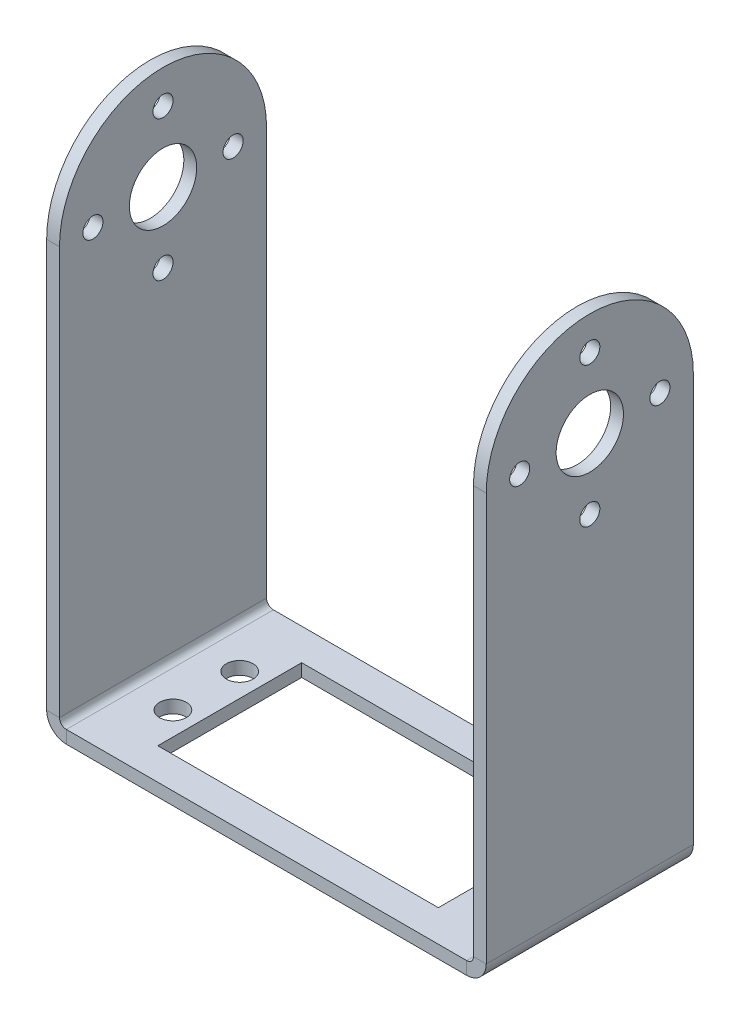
ISO-10303-21;
HEADER;
FILE_DESCRIPTION(('STEP AP214'),'2;1');
FILE_NAME('part.step','',(''),(''),'','','');
FILE_SCHEMA(('AUTOMOTIVE_DESIGN { 1 0 10303 214 1 1 1 1 }'));
ENDSEC;
DATA;
#1=APPLICATION_CONTEXT('core data for automotive mechanical design processes');
#2=APPLICATION_PROTOCOL_DEFINITION('international standard','automotive_design',2000,#1);
#3=PRODUCT_CONTEXT('',#1,'mechanical');
#4=PRODUCT('Part','Part','',(#3));
#5=PRODUCT_RELATED_PRODUCT_CATEGORY('part','',(#4));
#6=PRODUCT_DEFINITION_FORMATION('','',#4);
#7=PRODUCT_DEFINITION_CONTEXT('part definition',#1,'design');
#8=PRODUCT_DEFINITION('design','',#6,#7);
#9=PRODUCT_DEFINITION_SHAPE('','',#8);
#10=(LENGTH_UNIT() NAMED_UNIT(*) SI_UNIT(.MILLI.,.METRE.));
#11=(NAMED_UNIT(*) PLANE_ANGLE_UNIT() SI_UNIT($,.RADIAN.));
#12=(NAMED_UNIT(*) SI_UNIT($,.STERADIAN.) SOLID_ANGLE_UNIT());
#13=UNCERTAINTY_MEASURE_WITH_UNIT(LENGTH_MEASURE(1.E-05),#10,'distance_accuracy_value','');
#14=(GEOMETRIC_REPRESENTATION_CONTEXT(3) GLOBAL_UNCERTAINTY_ASSIGNED_CONTEXT((#13)) GLOBAL_UNIT_ASSIGNED_CONTEXT((#10,
#11,#12)) REPRESENTATION_CONTEXT('',''));
#15=CARTESIAN_POINT('',(0.,0.,0.));
#16=DIRECTION('',(0.,0.,1.));
#17=DIRECTION('',(1.,0.,0.));
#18=AXIS2_PLACEMENT_3D('',#15,#16,#17);
#19=CARTESIAN_POINT('',(26.1239,49.276,0.));
#20=DIRECTION('',(1.,0.,0.));
#21=DIRECTION('',(0.,1.,0.));
#22=AXIS2_PLACEMENT_3D('',#19,#20,#21);
#23=CYLINDRICAL_SURFACE('',#22,12.3063);
#24=DIRECTION('',(1.,0.,0.));
#25=VECTOR('',#24,1.);
#26=CARTESIAN_POINT('',(23.7871000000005,49.276,12.3063));
#27=LINE('',#26,#25);
#28=CARTESIAN_POINT('',(26.1239,49.276,12.3063));
#29=VERTEX_POINT('',#28);
#30=CARTESIAN_POINT('',(24.5999,49.276,12.3063));
#31=VERTEX_POINT('',#30);
#32=EDGE_CURVE('E351',#29,#31,#27,.F.);
#33=ORIENTED_EDGE('',*,*,#32,.F.);
#34=CARTESIAN_POINT('',(26.1239,49.276,0.));
#35=DIRECTION('',(-1.,0.,0.));
#36=DIRECTION('',(0.,0.,1.));
#37=AXIS2_PLACEMENT_3D('',#34,#35,#36);
#38=CIRCLE('',#37,12.3063);
#39=CARTESIAN_POINT('',(26.1239,49.276,-12.3063));
#40=VERTEX_POINT('',#39);
#41=EDGE_CURVE('E39',#40,#29,#38,.F.);
#42=ORIENTED_EDGE('',*,*,#41,.F.);
#43=DIRECTION('',(1.,0.,0.));
#44=VECTOR('',#43,1.);
#45=CARTESIAN_POINT('',(23.7871000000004,49.276,-12.3063));
#46=LINE('',#45,#44);
#47=CARTESIAN_POINT('',(24.5999,49.276,-12.3063));
#48=VERTEX_POINT('',#47);
#49=EDGE_CURVE('E354',#48,#40,#46,.T.);
#50=ORIENTED_EDGE('',*,*,#49,.F.);
#51=CARTESIAN_POINT('',(24.5999,49.276,0.));
#52=DIRECTION('',(-1.,0.,0.));
#53=DIRECTION('',(0.,0.,1.));
#54=AXIS2_PLACEMENT_3D('',#51,#52,#53);
#55=CIRCLE('',#54,12.3063);
#56=EDGE_CURVE('E11',#31,#48,#55,.T.);
#57=ORIENTED_EDGE('',*,*,#56,.F.);
#58=EDGE_LOOP('',(#33,#42,#50,#57));
#59=FACE_BOUND('',#58,.T.);
#60=ADVANCED_FACE('F32',(#59),#23,.T.);
#61=CARTESIAN_POINT('',(-24.5999,49.276,0.));
#62=DIRECTION('',(1.,0.,0.));
#63=DIRECTION('',(0.,1.,0.));
#64=AXIS2_PLACEMENT_3D('',#61,#62,#63);
#65=CYLINDRICAL_SURFACE('',#64,12.3063);
#66=DIRECTION('',(-1.,0.,0.));
#67=VECTOR('',#66,1.);
#68=CARTESIAN_POINT('',(-24.5999,49.276,12.3063));
#69=LINE('',#68,#67);
#70=CARTESIAN_POINT('',(-24.5999,49.276,12.3063));
#71=VERTEX_POINT('',#70);
#72=CARTESIAN_POINT('',(-26.1239,49.276,12.3063));
#73=VERTEX_POINT('',#72);
#74=EDGE_CURVE('E341',#71,#73,#69,.T.);
#75=ORIENTED_EDGE('',*,*,#74,.F.);
#76=CARTESIAN_POINT('',(-24.5999,49.276,0.));
#77=DIRECTION('',(1.,0.,0.));
#78=DIRECTION('',(0.,0.,-1.));
#79=AXIS2_PLACEMENT_3D('',#76,#77,#78);
#80=CIRCLE('',#79,12.3063);
#81=CARTESIAN_POINT('',(-24.5999,49.276,-12.3063));
#82=VERTEX_POINT('',#81);
#83=EDGE_CURVE('E347',#82,#71,#80,.T.);
#84=ORIENTED_EDGE('',*,*,#83,.F.);
#85=DIRECTION('',(1.,0.,0.));
#86=VECTOR('',#85,1.);
#87=CARTESIAN_POINT('',(-23.7871000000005,49.276,-12.3063));
#88=LINE('',#87,#86);
#89=CARTESIAN_POINT('',(-26.1239,49.276,-12.3063));
#90=VERTEX_POINT('',#89);
#91=EDGE_CURVE('E344',#90,#82,#88,.T.);
#92=ORIENTED_EDGE('',*,*,#91,.F.);
#93=CARTESIAN_POINT('',(-26.1239,49.276,0.));
#94=DIRECTION('',(1.,0.,0.));
#95=DIRECTION('',(0.,0.,-1.));
#96=AXIS2_PLACEMENT_3D('',#93,#94,#95);
#97=CIRCLE('',#96,12.3063);
#98=EDGE_CURVE('E349',#73,#90,#97,.F.);
#99=ORIENTED_EDGE('',*,*,#98,.F.);
#100=EDGE_LOOP('',(#75,#84,#92,#99));
#101=FACE_BOUND('',#100,.T.);
#102=ADVANCED_FACE('F430',(#101),#65,.T.);
#103=CARTESIAN_POINT('',(-23.7871,0.,12.3063));
#104=DIRECTION('',(0.,0.,1.));
#105=DIRECTION('',(1.,0.,0.));
#106=AXIS2_PLACEMENT_3D('',#103,#104,#105);
#107=PLANE('',#106);
#108=DIRECTION('',(0.,-1.,0.));
#109=VECTOR('',#108,1.);
#110=CARTESIAN_POINT('',(-23.7871,0.,12.3063));
#111=LINE('',#110,#109);
#112=CARTESIAN_POINT('',(-23.7871,0.,12.3063));
#113=VERTEX_POINT('',#112);
#114=CARTESIAN_POINT('',(-23.7871,-1.524,12.3063));
#115=VERTEX_POINT('',#114);
#116=EDGE_CURVE('E339',#113,#115,#111,.T.);
#117=ORIENTED_EDGE('',*,*,#116,.F.);
#118=CARTESIAN_POINT('',(-23.7871,0.8128,12.3063));
#119=DIRECTION('',(0.,0.,-1.));
#120=DIRECTION('',(-1.,0.,0.));
#121=AXIS2_PLACEMENT_3D('',#118,#119,#120);
#122=CIRCLE('',#121,0.8128);
#123=CARTESIAN_POINT('',(-24.5999,0.8128,12.3063));
#124=VERTEX_POINT('',#123);
#125=EDGE_CURVE('E257',#124,#113,#122,.F.);
#126=ORIENTED_EDGE('',*,*,#125,.F.);
#127=DIRECTION('',(1.,0.,0.));
#128=VECTOR('',#127,1.);
#129=CARTESIAN_POINT('',(-26.1239,0.8128,12.3063));
#130=LINE('',#129,#128);
#131=CARTESIAN_POINT('',(-26.1239,0.8128,12.3063));
#132=VERTEX_POINT('',#131);
#133=EDGE_CURVE('E336',#132,#124,#130,.T.);
#134=ORIENTED_EDGE('',*,*,#133,.F.);
#135=CARTESIAN_POINT('',(-23.7871,0.8128,12.3063));
#136=DIRECTION('',(0.,0.,1.));
#137=DIRECTION('',(1.,0.,0.));
#138=AXIS2_PLACEMENT_3D('',#135,#136,#137);
#139=CIRCLE('',#138,2.3368);
#140=EDGE_CURVE('E264',#132,#115,#139,.T.);
#141=ORIENTED_EDGE('',*,*,#140,.T.);
#142=EDGE_LOOP('',(#117,#126,#134,#141));
#143=FACE_BOUND('',#142,.T.);
#144=ADVANCED_FACE('F405',(#143),#107,.T.);
#145=CARTESIAN_POINT('',(-26.1239,0.8128,12.3063));
#146=DIRECTION('',(0.,0.,1.));
#147=DIRECTION('',(1.,0.,0.));
#148=AXIS2_PLACEMENT_3D('',#145,#146,#147);
#149=PLANE('',#148);
#150=DIRECTION('',(1.,0.,0.));
#151=VECTOR('',#150,1.);
#152=CARTESIAN_POINT('',(-24.5999,0.,12.3063));
#153=LINE('',#152,#151);
#154=CARTESIAN_POINT('',(23.7871,0.,12.3063));
#155=VERTEX_POINT('',#154);
#156=EDGE_CURVE('E254',#113,#155,#153,.T.);
#157=ORIENTED_EDGE('',*,*,#156,.F.);
#158=ORIENTED_EDGE('',*,*,#116,.T.);
#159=DIRECTION('',(1.,0.,0.));
#160=VECTOR('',#159,1.);
#161=CARTESIAN_POINT('',(-24.5999,-1.524,12.3063));
#162=LINE('',#161,#160);
#163=CARTESIAN_POINT('',(23.7871,-1.524,12.3063));
#164=VERTEX_POINT('',#163);
#165=EDGE_CURVE('E267',#115,#164,#162,.T.);
#166=ORIENTED_EDGE('',*,*,#165,.T.);
#167=DIRECTION('',(0.,1.,0.));
#168=VECTOR('',#167,1.);
#169=CARTESIAN_POINT('',(23.7871,-1.524,12.3063));
#170=LINE('',#169,#168);
#171=EDGE_CURVE('E327',#164,#155,#170,.T.);
#172=ORIENTED_EDGE('',*,*,#171,.T.);
#173=EDGE_LOOP('',(#157,#158,#166,#172));
#174=FACE_BOUND('',#173,.T.);
#175=ADVANCED_FACE('F410',(#174),#149,.T.);
#176=CARTESIAN_POINT('',(-24.5999,0.8128,-12.3063));
#177=DIRECTION('',(0.,0.,-1.));
#178=DIRECTION('',(-1.,0.,0.));
#179=AXIS2_PLACEMENT_3D('',#176,#177,#178);
#180=PLANE('',#179);
#181=DIRECTION('',(-1.,0.,0.));
#182=VECTOR('',#181,1.);
#183=CARTESIAN_POINT('',(-24.5999,0.8128,-12.3063));
#184=LINE('',#183,#182);
#185=CARTESIAN_POINT('',(-24.5999,0.8128,-12.3063));
#186=VERTEX_POINT('',#185);
#187=CARTESIAN_POINT('',(-26.1239,0.8128,-12.3063));
#188=VERTEX_POINT('',#187);
#189=EDGE_CURVE('E333',#186,#188,#184,.T.);
#190=ORIENTED_EDGE('',*,*,#189,.F.);
#191=CARTESIAN_POINT('',(-23.7871,0.8128,-12.3063));
#192=DIRECTION('',(0.,0.,-1.));
#193=DIRECTION('',(-1.,0.,0.));
#194=AXIS2_PLACEMENT_3D('',#191,#192,#193);
#195=CIRCLE('',#194,0.8128);
#196=CARTESIAN_POINT('',(-23.7871,0.,-12.3063));
#197=VERTEX_POINT('',#196);
#198=EDGE_CURVE('E285',#186,#197,#195,.F.);
#199=ORIENTED_EDGE('',*,*,#198,.T.);
#200=DIRECTION('',(0.,1.,0.));
#201=VECTOR('',#200,1.);
#202=CARTESIAN_POINT('',(-23.7871,-1.524,-12.3063));
#203=LINE('',#202,#201);
#204=CARTESIAN_POINT('',(-23.7871,-1.524,-12.3063));
#205=VERTEX_POINT('',#204);
#206=EDGE_CURVE('E331',#205,#197,#203,.T.);
#207=ORIENTED_EDGE('',*,*,#206,.F.);
#208=CARTESIAN_POINT('',(-23.7871,0.8128,-12.3063));
#209=DIRECTION('',(0.,0.,1.));
#210=DIRECTION('',(1.,0.,0.));
#211=AXIS2_PLACEMENT_3D('',#208,#209,#210);
#212=CIRCLE('',#211,2.3368);
#213=EDGE_CURVE('E292',#188,#205,#212,.T.);
#214=ORIENTED_EDGE('',*,*,#213,.F.);
#215=EDGE_LOOP('',(#190,#199,#207,#214));
#216=FACE_BOUND('',#215,.T.);
#217=ADVANCED_FACE('F397',(#216),#180,.T.);
#218=CARTESIAN_POINT('',(-23.7871,-1.524,-12.3063));
#219=DIRECTION('',(0.,0.,-1.));
#220=DIRECTION('',(-1.,0.,0.));
#221=AXIS2_PLACEMENT_3D('',#218,#219,#220);
#222=PLANE('',#221);
#223=DIRECTION('',(0.,1.,0.));
#224=VECTOR('',#223,1.);
#225=CARTESIAN_POINT('',(-26.1239,0.,-12.3063));
#226=LINE('',#225,#224);
#227=EDGE_CURVE('E290',#90,#188,#226,.F.);
#228=ORIENTED_EDGE('',*,*,#227,.F.);
#229=ORIENTED_EDGE('',*,*,#91,.T.);
#230=DIRECTION('',(0.,-1.,0.));
#231=VECTOR('',#230,1.);
#232=CARTESIAN_POINT('',(-24.5999,0.,-12.3063));
#233=LINE('',#232,#231);
#234=EDGE_CURVE('E288',#82,#186,#233,.T.);
#235=ORIENTED_EDGE('',*,*,#234,.T.);
#236=ORIENTED_EDGE('',*,*,#189,.T.);
#237=EDGE_LOOP('',(#228,#229,#235,#236));
#238=FACE_BOUND('',#237,.T.);
#239=ADVANCED_FACE('F421',(#238),#222,.T.);
#240=CARTESIAN_POINT('',(24.5999,0.8128,12.3063));
#241=DIRECTION('',(0.,0.,1.));
#242=DIRECTION('',(1.,0.,0.));
#243=AXIS2_PLACEMENT_3D('',#240,#241,#242);
#244=PLANE('',#243);
#245=DIRECTION('',(1.,0.,0.));
#246=VECTOR('',#245,1.);
#247=CARTESIAN_POINT('',(24.5999,0.8128,12.3063));
#248=LINE('',#247,#246);
#249=CARTESIAN_POINT('',(24.5999,0.8128,12.3063));
#250=VERTEX_POINT('',#249);
#251=CARTESIAN_POINT('',(26.1239,0.8128,12.3063));
#252=VERTEX_POINT('',#251);
#253=EDGE_CURVE('E329',#250,#252,#248,.T.);
#254=ORIENTED_EDGE('',*,*,#253,.F.);
#255=CARTESIAN_POINT('',(23.7871,0.8128,12.3063));
#256=DIRECTION('',(0.,0.,-1.));
#257=DIRECTION('',(-1.,0.,0.));
#258=AXIS2_PLACEMENT_3D('',#255,#256,#257);
#259=CIRCLE('',#258,0.8128);
#260=EDGE_CURVE('E251',#155,#250,#259,.F.);
#261=ORIENTED_EDGE('',*,*,#260,.F.);
#262=ORIENTED_EDGE('',*,*,#171,.F.);
#263=CARTESIAN_POINT('',(23.7871,0.8128,12.3063));
#264=DIRECTION('',(0.,0.,1.));
#265=DIRECTION('',(1.,0.,0.));
#266=AXIS2_PLACEMENT_3D('',#263,#264,#265);
#267=CIRCLE('',#266,2.3368);
#268=EDGE_CURVE('E270',#164,#252,#267,.T.);
#269=ORIENTED_EDGE('',*,*,#268,.T.);
#270=EDGE_LOOP('',(#254,#261,#262,#269));
#271=FACE_BOUND('',#270,.T.);
#272=ADVANCED_FACE('F371',(#271),#244,.T.);
#273=CARTESIAN_POINT('',(23.7871,-1.524,12.3063));
#274=DIRECTION('',(0.,0.,1.));
#275=DIRECTION('',(1.,0.,0.));
#276=AXIS2_PLACEMENT_3D('',#273,#274,#275);
#277=PLANE('',#276);
#278=DIRECTION('',(0.,1.,0.));
#279=VECTOR('',#278,1.);
#280=CARTESIAN_POINT('',(26.1239,0.,12.3063));
#281=LINE('',#280,#279);
#282=EDGE_CURVE('E244',#252,#29,#281,.T.);
#283=ORIENTED_EDGE('',*,*,#282,.T.);
#284=ORIENTED_EDGE('',*,*,#32,.T.);
#285=DIRECTION('',(0.,1.,0.));
#286=VECTOR('',#285,1.);
#287=CARTESIAN_POINT('',(24.5999,0.,12.3063));
#288=LINE('',#287,#286);
#289=EDGE_CURVE('E247',#250,#31,#288,.T.);
#290=ORIENTED_EDGE('',*,*,#289,.F.);
#291=ORIENTED_EDGE('',*,*,#253,.T.);
#292=EDGE_LOOP('',(#283,#284,#290,#291));
#293=FACE_BOUND('',#292,.T.);
#294=ADVANCED_FACE('F365',(#293),#277,.T.);
#295=CARTESIAN_POINT('',(23.7871,0.,-12.3063));
#296=DIRECTION('',(0.,0.,-1.));
#297=DIRECTION('',(-1.,0.,0.));
#298=AXIS2_PLACEMENT_3D('',#295,#296,#297);
#299=PLANE('',#298);
#300=DIRECTION('',(0.,-1.,0.));
#301=VECTOR('',#300,1.);
#302=CARTESIAN_POINT('',(23.7871,0.,-12.3063));
#303=LINE('',#302,#301);
#304=CARTESIAN_POINT('',(23.7871,0.,-12.3063));
#305=VERTEX_POINT('',#304);
#306=CARTESIAN_POINT('',(23.7871,-1.524,-12.3063));
#307=VERTEX_POINT('',#306);
#308=EDGE_CURVE('E325',#305,#307,#303,.T.);
#309=ORIENTED_EDGE('',*,*,#308,.F.);
#310=CARTESIAN_POINT('',(23.7871,0.8128,-12.3063));
#311=DIRECTION('',(0.,0.,-1.));
#312=DIRECTION('',(-1.,0.,0.));
#313=AXIS2_PLACEMENT_3D('',#310,#311,#312);
#314=CIRCLE('',#313,0.8128);
#315=CARTESIAN_POINT('',(24.5999,0.8128,-12.3063));
#316=VERTEX_POINT('',#315);
#317=EDGE_CURVE('E279',#305,#316,#314,.F.);
#318=ORIENTED_EDGE('',*,*,#317,.T.);
#319=DIRECTION('',(-1.,0.,0.));
#320=VECTOR('',#319,1.);
#321=CARTESIAN_POINT('',(26.1239,0.8128,-12.3063));
#322=LINE('',#321,#320);
#323=CARTESIAN_POINT('',(26.1239,0.8128,-12.3063));
#324=VERTEX_POINT('',#323);
#325=EDGE_CURVE('E323',#324,#316,#322,.T.);
#326=ORIENTED_EDGE('',*,*,#325,.F.);
#327=CARTESIAN_POINT('',(23.7871,0.8128,-12.3063));
#328=DIRECTION('',(0.,0.,1.));
#329=DIRECTION('',(1.,0.,0.));
#330=AXIS2_PLACEMENT_3D('',#327,#328,#329);
#331=CIRCLE('',#330,2.3368);
#332=EDGE_CURVE('E248',#307,#324,#331,.T.);
#333=ORIENTED_EDGE('',*,*,#332,.F.);
#334=EDGE_LOOP('',(#309,#318,#326,#333));
#335=FACE_BOUND('',#334,.T.);
#336=ADVANCED_FACE('F382',(#335),#299,.T.);
#337=CARTESIAN_POINT('',(26.1239,0.8128,-12.3063));
#338=DIRECTION('',(0.,0.,-1.));
#339=DIRECTION('',(-1.,0.,0.));
#340=AXIS2_PLACEMENT_3D('',#337,#338,#339);
#341=PLANE('',#340);
#342=DIRECTION('',(1.,0.,0.));
#343=VECTOR('',#342,1.);
#344=CARTESIAN_POINT('',(-24.5999,0.,-12.3063));
#345=LINE('',#344,#343);
#346=EDGE_CURVE('E282',#197,#305,#345,.T.);
#347=ORIENTED_EDGE('',*,*,#346,.T.);
#348=ORIENTED_EDGE('',*,*,#308,.T.);
#349=DIRECTION('',(1.,0.,0.));
#350=VECTOR('',#349,1.);
#351=CARTESIAN_POINT('',(-24.5999,-1.524,-12.3063));
#352=LINE('',#351,#350);
#353=EDGE_CURVE('E295',#205,#307,#352,.T.);
#354=ORIENTED_EDGE('',*,*,#353,.F.);
#355=ORIENTED_EDGE('',*,*,#206,.T.);
#356=EDGE_LOOP('',(#347,#348,#354,#355));
#357=FACE_BOUND('',#356,.T.);
#358=ADVANCED_FACE('F388',(#357),#341,.T.);
#359=CARTESIAN_POINT('',(26.1239,0.,12.3063));
#360=DIRECTION('',(-1.,0.,0.));
#361=DIRECTION('',(0.,0.,1.));
#362=AXIS2_PLACEMENT_3D('',#359,#360,#361);
#363=PLANE('',#362);
#364=CARTESIAN_POINT('',(26.1239,49.276,8.3312));
#365=DIRECTION('',(1.,0.,0.));
#366=DIRECTION('',(0.,0.,-1.));
#367=AXIS2_PLACEMENT_3D('',#364,#365,#366);
#368=CIRCLE('',#367,1.1938);
#369=CARTESIAN_POINT('',(26.1239,49.276,7.1374));
#370=VERTEX_POINT('',#369);
#371=EDGE_CURVE('E180',#370,#370,#368,.T.);
#372=ORIENTED_EDGE('',*,*,#371,.F.);
#373=EDGE_LOOP('',(#372));
#374=FACE_BOUND('',#373,.T.);
#375=CARTESIAN_POINT('',(26.1239,40.9448,0.));
#376=DIRECTION('',(1.,0.,0.));
#377=DIRECTION('',(0.,0.,-1.));
#378=AXIS2_PLACEMENT_3D('',#375,#376,#377);
#379=CIRCLE('',#378,1.1938);
#380=CARTESIAN_POINT('',(26.1239,40.9448,-1.1938));
#381=VERTEX_POINT('',#380);
#382=EDGE_CURVE('E195',#381,#381,#379,.T.);
#383=ORIENTED_EDGE('',*,*,#382,.F.);
#384=EDGE_LOOP('',(#383));
#385=FACE_BOUND('',#384,.T.);
#386=CARTESIAN_POINT('',(26.1239,49.276,-8.3312));
#387=DIRECTION('',(1.,0.,0.));
#388=DIRECTION('',(0.,0.,-1.));
#389=AXIS2_PLACEMENT_3D('',#386,#387,#388);
#390=CIRCLE('',#389,1.1938);
#391=CARTESIAN_POINT('',(26.1239,49.276,-9.525));
#392=VERTEX_POINT('',#391);
#393=EDGE_CURVE('E207',#392,#392,#390,.T.);
#394=ORIENTED_EDGE('',*,*,#393,.F.);
#395=EDGE_LOOP('',(#394));
#396=FACE_BOUND('',#395,.T.);
#397=CARTESIAN_POINT('',(26.1239,57.6072,0.));
#398=DIRECTION('',(1.,0.,0.));
#399=DIRECTION('',(0.,0.,-1.));
#400=AXIS2_PLACEMENT_3D('',#397,#398,#399);
#401=CIRCLE('',#400,1.1938);
#402=CARTESIAN_POINT('',(26.1239,57.6072,-1.1938));
#403=VERTEX_POINT('',#402);
#404=EDGE_CURVE('E219',#403,#403,#401,.T.);
#405=ORIENTED_EDGE('',*,*,#404,.F.);
#406=EDGE_LOOP('',(#405));
#407=FACE_BOUND('',#406,.T.);
#408=CARTESIAN_POINT('',(26.1239,49.276,0.));
#409=DIRECTION('',(1.,0.,0.));
#410=DIRECTION('',(0.,0.,-1.));
#411=AXIS2_PLACEMENT_3D('',#408,#409,#410);
#412=CIRCLE('',#411,4.00050000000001);
#413=CARTESIAN_POINT('',(26.1239,49.276,-4.00050000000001));
#414=VERTEX_POINT('',#413);
#415=EDGE_CURVE('E231',#414,#414,#412,.T.);
#416=ORIENTED_EDGE('',*,*,#415,.F.);
#417=EDGE_LOOP('',(#416));
#418=FACE_BOUND('',#417,.T.);
#419=DIRECTION('',(0.,1.,0.));
#420=VECTOR('',#419,1.);
#421=CARTESIAN_POINT('',(26.1239,0.,-12.3063));
#422=LINE('',#421,#420);
#423=EDGE_CURVE('E243',#324,#40,#422,.T.);
#424=ORIENTED_EDGE('',*,*,#423,.T.);
#425=ORIENTED_EDGE('',*,*,#41,.T.);
#426=ORIENTED_EDGE('',*,*,#282,.F.);
#427=DIRECTION('',(0.,0.,-1.));
#428=VECTOR('',#427,1.);
#429=CARTESIAN_POINT('',(26.1239,0.8128,12.3063));
#430=LINE('',#429,#428);
#431=EDGE_CURVE('E273',#252,#324,#430,.T.);
#432=ORIENTED_EDGE('',*,*,#431,.T.);
#433=EDGE_LOOP('',(#424,#425,#426,#432));
#434=FACE_BOUND('',#433,.T.);
#435=ADVANCED_FACE('F359',(#374,#385,#396,#407,#418,#434),#363,.F.);
#436=CARTESIAN_POINT('',(24.5999,0.,12.3063));
#437=DIRECTION('',(-1.,0.,0.));
#438=DIRECTION('',(0.,0.,1.));
#439=AXIS2_PLACEMENT_3D('',#436,#437,#438);
#440=PLANE('',#439);
#441=CARTESIAN_POINT('',(24.5999,49.276,8.3312));
#442=DIRECTION('',(-1.,0.,0.));
#443=DIRECTION('',(0.,0.,1.));
#444=AXIS2_PLACEMENT_3D('',#441,#442,#443);
#445=CIRCLE('',#444,1.1938);
#446=CARTESIAN_POINT('',(24.5999,49.276,9.525));
#447=VERTEX_POINT('',#446);
#448=EDGE_CURVE('E192',#447,#447,#445,.T.);
#449=ORIENTED_EDGE('',*,*,#448,.F.);
#450=EDGE_LOOP('',(#449));
#451=FACE_BOUND('',#450,.T.);
#452=CARTESIAN_POINT('',(24.5999,40.9448,0.));
#453=DIRECTION('',(-1.,0.,0.));
#454=DIRECTION('',(0.,0.,1.));
#455=AXIS2_PLACEMENT_3D('',#452,#453,#454);
#456=CIRCLE('',#455,1.1938);
#457=CARTESIAN_POINT('',(24.5999,40.9448,1.1938));
#458=VERTEX_POINT('',#457);
#459=EDGE_CURVE('E204',#458,#458,#456,.T.);
#460=ORIENTED_EDGE('',*,*,#459,.F.);
#461=EDGE_LOOP('',(#460));
#462=FACE_BOUND('',#461,.T.);
#463=CARTESIAN_POINT('',(24.5999,49.276,-8.3312));
#464=DIRECTION('',(-1.,0.,0.));
#465=DIRECTION('',(0.,0.,1.));
#466=AXIS2_PLACEMENT_3D('',#463,#464,#465);
#467=CIRCLE('',#466,1.1938);
#468=CARTESIAN_POINT('',(24.5999,49.276,-7.1374));
#469=VERTEX_POINT('',#468);
#470=EDGE_CURVE('E216',#469,#469,#467,.T.);
#471=ORIENTED_EDGE('',*,*,#470,.F.);
#472=EDGE_LOOP('',(#471));
#473=FACE_BOUND('',#472,.T.);
#474=CARTESIAN_POINT('',(24.5999,57.6072,0.));
#475=DIRECTION('',(-1.,0.,0.));
#476=DIRECTION('',(0.,0.,1.));
#477=AXIS2_PLACEMENT_3D('',#474,#475,#476);
#478=CIRCLE('',#477,1.1938);
#479=CARTESIAN_POINT('',(24.5999,57.6072,1.1938));
#480=VERTEX_POINT('',#479);
#481=EDGE_CURVE('E228',#480,#480,#478,.T.);
#482=ORIENTED_EDGE('',*,*,#481,.F.);
#483=EDGE_LOOP('',(#482));
#484=FACE_BOUND('',#483,.T.);
#485=CARTESIAN_POINT('',(24.5999,49.276,0.));
#486=DIRECTION('',(-1.,0.,0.));
#487=DIRECTION('',(0.,0.,1.));
#488=AXIS2_PLACEMENT_3D('',#485,#486,#487);
#489=CIRCLE('',#488,4.00050000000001);
#490=CARTESIAN_POINT('',(24.5999,49.276,4.00050000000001));
#491=VERTEX_POINT('',#490);
#492=EDGE_CURVE('E240',#491,#491,#489,.T.);
#493=ORIENTED_EDGE('',*,*,#492,.F.);
#494=EDGE_LOOP('',(#493));
#495=FACE_BOUND('',#494,.T.);
#496=ORIENTED_EDGE('',*,*,#289,.T.);
#497=ORIENTED_EDGE('',*,*,#56,.T.);
#498=DIRECTION('',(0.,1.,0.));
#499=VECTOR('',#498,1.);
#500=CARTESIAN_POINT('',(24.5999,0.,-12.3063));
#501=LINE('',#500,#499);
#502=EDGE_CURVE('E276',#316,#48,#501,.T.);
#503=ORIENTED_EDGE('',*,*,#502,.F.);
#504=DIRECTION('',(0.,0.,-1.));
#505=VECTOR('',#504,1.);
#506=CARTESIAN_POINT('',(24.5999,0.8128,12.3063));
#507=LINE('',#506,#505);
#508=EDGE_CURVE('E320',#250,#316,#507,.T.);
#509=ORIENTED_EDGE('',*,*,#508,.F.);
#510=EDGE_LOOP('',(#496,#497,#503,#509));
#511=FACE_BOUND('',#510,.T.);
#512=ADVANCED_FACE('F379',(#451,#462,#473,#484,#495,#511),#440,.T.);
#513=CARTESIAN_POINT('',(23.7871,0.8128,12.3063));
#514=DIRECTION('',(0.,0.,-1.));
#515=DIRECTION('',(-1.,0.,0.));
#516=AXIS2_PLACEMENT_3D('',#513,#514,#515);
#517=CYLINDRICAL_SURFACE('',#516,0.8128);
#518=ORIENTED_EDGE('',*,*,#317,.F.);
#519=DIRECTION('',(0.,0.,-1.));
#520=VECTOR('',#519,1.);
#521=CARTESIAN_POINT('',(23.7871,0.,12.3063));
#522=LINE('',#521,#520);
#523=EDGE_CURVE('E317',#155,#305,#522,.T.);
#524=ORIENTED_EDGE('',*,*,#523,.F.);
#525=ORIENTED_EDGE('',*,*,#260,.T.);
#526=ORIENTED_EDGE('',*,*,#508,.T.);
#527=EDGE_LOOP('',(#518,#524,#525,#526));
#528=FACE_BOUND('',#527,.T.);
#529=ADVANCED_FACE('F385',(#528),#517,.F.);
#530=CARTESIAN_POINT('',(-24.5999,0.,12.3063));
#531=DIRECTION('',(0.,1.,0.));
#532=DIRECTION('',(0.,0.,1.));
#533=AXIS2_PLACEMENT_3D('',#530,#531,#532);
#534=PLANE('',#533);
#535=CARTESIAN_POINT('',(-19.4564,0.,3.96875));
#536=DIRECTION('',(0.,1.,0.));
#537=DIRECTION('',(0.,0.,1.));
#538=AXIS2_PLACEMENT_3D('',#535,#536,#537);
#539=CIRCLE('',#538,1.5875);
#540=CARTESIAN_POINT('',(-19.4564,0.,5.55625));
#541=VERTEX_POINT('',#540);
#542=EDGE_CURVE('E541',#541,#541,#539,.T.);
#543=ORIENTED_EDGE('',*,*,#542,.F.);
#544=EDGE_LOOP('',(#543));
#545=FACE_BOUND('',#544,.T.);
#546=CARTESIAN_POINT('',(-19.4564,0.,-3.96875));
#547=DIRECTION('',(0.,1.,0.));
#548=DIRECTION('',(0.,0.,1.));
#549=AXIS2_PLACEMENT_3D('',#546,#547,#548);
#550=CIRCLE('',#549,1.5875);
#551=CARTESIAN_POINT('',(-19.4564,0.,-2.38125));
#552=VERTEX_POINT('',#551);
#553=EDGE_CURVE('E543',#552,#552,#550,.T.);
#554=ORIENTED_EDGE('',*,*,#553,.F.);
#555=EDGE_LOOP('',(#554));
#556=FACE_BOUND('',#555,.T.);
#557=CARTESIAN_POINT('',(19.4564,0.,3.96875));
#558=DIRECTION('',(0.,1.,0.));
#559=DIRECTION('',(0.,0.,1.));
#560=AXIS2_PLACEMENT_3D('',#557,#558,#559);
#561=CIRCLE('',#560,1.5875);
#562=CARTESIAN_POINT('',(19.4564,0.,5.55625));
#563=VERTEX_POINT('',#562);
#564=EDGE_CURVE('E549',#563,#563,#561,.T.);
#565=ORIENTED_EDGE('',*,*,#564,.F.);
#566=EDGE_LOOP('',(#565));
#567=FACE_BOUND('',#566,.T.);
#568=CARTESIAN_POINT('',(19.4564,0.,-3.96875));
#569=DIRECTION('',(0.,1.,0.));
#570=DIRECTION('',(0.,0.,1.));
#571=AXIS2_PLACEMENT_3D('',#568,#569,#570);
#572=CIRCLE('',#571,1.5875);
#573=CARTESIAN_POINT('',(19.4564,0.,-2.38125));
#574=VERTEX_POINT('',#573);
#575=EDGE_CURVE('E167',#574,#574,#572,.T.);
#576=ORIENTED_EDGE('',*,*,#575,.F.);
#577=EDGE_LOOP('',(#576));
#578=FACE_BOUND('',#577,.T.);
#579=DIRECTION('',(0.,0.,-1.));
#580=VECTOR('',#579,1.);
#581=CARTESIAN_POINT('',(16.66875,0.,-8.5471));
#582=LINE('',#581,#580);
#583=CARTESIAN_POINT('',(16.66875,0.,8.5471));
#584=VERTEX_POINT('',#583);
#585=CARTESIAN_POINT('',(16.66875,0.,-8.5471));
#586=VERTEX_POINT('',#585);
#587=EDGE_CURVE('E46',#584,#586,#582,.T.);
#588=ORIENTED_EDGE('',*,*,#587,.F.);
#589=DIRECTION('',(1.,0.,0.));
#590=VECTOR('',#589,1.);
#591=CARTESIAN_POINT('',(-16.66875,0.,8.5471));
#592=LINE('',#591,#590);
#593=CARTESIAN_POINT('',(-16.66875,0.,8.5471));
#594=VERTEX_POINT('',#593);
#595=EDGE_CURVE('E161',#594,#584,#592,.T.);
#596=ORIENTED_EDGE('',*,*,#595,.F.);
#597=DIRECTION('',(0.,0.,1.));
#598=VECTOR('',#597,1.);
#599=CARTESIAN_POINT('',(-16.66875,0.,-8.5471));
#600=LINE('',#599,#598);
#601=CARTESIAN_POINT('',(-16.66875,0.,-8.5471));
#602=VERTEX_POINT('',#601);
#603=EDGE_CURVE('E164',#602,#594,#600,.T.);
#604=ORIENTED_EDGE('',*,*,#603,.F.);
#605=DIRECTION('',(-1.,0.,0.));
#606=VECTOR('',#605,1.);
#607=CARTESIAN_POINT('',(-16.66875,0.,-8.5471));
#608=LINE('',#607,#606);
#609=EDGE_CURVE('E173',#586,#602,#608,.T.);
#610=ORIENTED_EDGE('',*,*,#609,.F.);
#611=EDGE_LOOP('',(#588,#596,#604,#610));
#612=FACE_BOUND('',#611,.T.);
#613=ORIENTED_EDGE('',*,*,#346,.F.);
#614=DIRECTION('',(0.,0.,-1.));
#615=VECTOR('',#614,1.);
#616=CARTESIAN_POINT('',(-23.7871,0.,12.3063));
#617=LINE('',#616,#615);
#618=EDGE_CURVE('E314',#113,#197,#617,.T.);
#619=ORIENTED_EDGE('',*,*,#618,.F.);
#620=ORIENTED_EDGE('',*,*,#156,.T.);
#621=ORIENTED_EDGE('',*,*,#523,.T.);
#622=EDGE_LOOP('',(#613,#619,#620,#621));
#623=FACE_BOUND('',#622,.T.);
#624=ADVANCED_FACE('F392',(#545,#556,#567,#578,#612,#623),#534,.T.);
#625=CARTESIAN_POINT('',(-23.7871,0.8128,12.3063));
#626=DIRECTION('',(0.,0.,-1.));
#627=DIRECTION('',(-1.,0.,0.));
#628=AXIS2_PLACEMENT_3D('',#625,#626,#627);
#629=CYLINDRICAL_SURFACE('',#628,0.8128);
#630=ORIENTED_EDGE('',*,*,#198,.F.);
#631=DIRECTION('',(0.,0.,-1.));
#632=VECTOR('',#631,1.);
#633=CARTESIAN_POINT('',(-24.5999,0.8128,12.3063));
#634=LINE('',#633,#632);
#635=EDGE_CURVE('E311',#124,#186,#634,.T.);
#636=ORIENTED_EDGE('',*,*,#635,.F.);
#637=ORIENTED_EDGE('',*,*,#125,.T.);
#638=ORIENTED_EDGE('',*,*,#618,.T.);
#639=EDGE_LOOP('',(#630,#636,#637,#638));
#640=FACE_BOUND('',#639,.T.);
#641=ADVANCED_FACE('F401',(#640),#629,.F.);
#642=CARTESIAN_POINT('',(-24.5999,0.,12.3063));
#643=DIRECTION('',(1.,0.,0.));
#644=DIRECTION('',(0.,0.,-1.));
#645=AXIS2_PLACEMENT_3D('',#642,#643,#644);
#646=PLANE('',#645);
#647=CARTESIAN_POINT('',(-24.5999,49.276,8.3312));
#648=DIRECTION('',(1.,0.,0.));
#649=DIRECTION('',(0.,0.,-1.));
#650=AXIS2_PLACEMENT_3D('',#647,#648,#649);
#651=CIRCLE('',#650,1.1938);
#652=CARTESIAN_POINT('',(-24.5999,49.276,7.1374));
#653=VERTEX_POINT('',#652);
#654=EDGE_CURVE('E187',#653,#653,#651,.T.);
#655=ORIENTED_EDGE('',*,*,#654,.F.);
#656=EDGE_LOOP('',(#655));
#657=FACE_BOUND('',#656,.T.);
#658=CARTESIAN_POINT('',(-24.5999,40.9448,0.));
#659=DIRECTION('',(1.,0.,0.));
#660=DIRECTION('',(0.,0.,-1.));
#661=AXIS2_PLACEMENT_3D('',#658,#659,#660);
#662=CIRCLE('',#661,1.1938);
#663=CARTESIAN_POINT('',(-24.5999,40.9448,-1.1938));
#664=VERTEX_POINT('',#663);
#665=EDGE_CURVE('E199',#664,#664,#662,.T.);
#666=ORIENTED_EDGE('',*,*,#665,.F.);
#667=EDGE_LOOP('',(#666));
#668=FACE_BOUND('',#667,.T.);
#669=CARTESIAN_POINT('',(-24.5999,49.276,-8.3312));
#670=DIRECTION('',(1.,0.,0.));
#671=DIRECTION('',(0.,0.,-1.));
#672=AXIS2_PLACEMENT_3D('',#669,#670,#671);
#673=CIRCLE('',#672,1.1938);
#674=CARTESIAN_POINT('',(-24.5999,49.276,-9.525));
#675=VERTEX_POINT('',#674);
#676=EDGE_CURVE('E211',#675,#675,#673,.T.);
#677=ORIENTED_EDGE('',*,*,#676,.F.);
#678=EDGE_LOOP('',(#677));
#679=FACE_BOUND('',#678,.T.);
#680=CARTESIAN_POINT('',(-24.5999,57.6072,0.));
#681=DIRECTION('',(1.,0.,0.));
#682=DIRECTION('',(0.,0.,-1.));
#683=AXIS2_PLACEMENT_3D('',#680,#681,#682);
#684=CIRCLE('',#683,1.1938);
#685=CARTESIAN_POINT('',(-24.5999,57.6072,-1.1938));
#686=VERTEX_POINT('',#685);
#687=EDGE_CURVE('E223',#686,#686,#684,.T.);
#688=ORIENTED_EDGE('',*,*,#687,.F.);
#689=EDGE_LOOP('',(#688));
#690=FACE_BOUND('',#689,.T.);
#691=CARTESIAN_POINT('',(-24.5999,49.276,0.));
#692=DIRECTION('',(1.,0.,0.));
#693=DIRECTION('',(0.,0.,-1.));
#694=AXIS2_PLACEMENT_3D('',#691,#692,#693);
#695=CIRCLE('',#694,4.00050000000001);
#696=CARTESIAN_POINT('',(-24.5999,49.276,-4.00050000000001));
#697=VERTEX_POINT('',#696);
#698=EDGE_CURVE('E235',#697,#697,#695,.T.);
#699=ORIENTED_EDGE('',*,*,#698,.F.);
#700=EDGE_LOOP('',(#699));
#701=FACE_BOUND('',#700,.T.);
#702=ORIENTED_EDGE('',*,*,#234,.F.);
#703=ORIENTED_EDGE('',*,*,#83,.T.);
#704=DIRECTION('',(0.,-1.,0.));
#705=VECTOR('',#704,1.);
#706=CARTESIAN_POINT('',(-24.5999,0.,12.3063));
#707=LINE('',#706,#705);
#708=EDGE_CURVE('E260',#71,#124,#707,.T.);
#709=ORIENTED_EDGE('',*,*,#708,.T.);
#710=ORIENTED_EDGE('',*,*,#635,.T.);
#711=EDGE_LOOP('',(#702,#703,#709,#710));
#712=FACE_BOUND('',#711,.T.);
#713=ADVANCED_FACE('F424',(#657,#668,#679,#690,#701,#712),#646,.T.);
#714=CARTESIAN_POINT('',(-26.1239,0.,12.3063));
#715=DIRECTION('',(1.,0.,0.));
#716=DIRECTION('',(0.,0.,-1.));
#717=AXIS2_PLACEMENT_3D('',#714,#715,#716);
#718=PLANE('',#717);
#719=CARTESIAN_POINT('',(-26.1239,49.276,8.3312));
#720=DIRECTION('',(1.,0.,0.));
#721=DIRECTION('',(0.,0.,-1.));
#722=AXIS2_PLACEMENT_3D('',#719,#720,#721);
#723=CIRCLE('',#722,1.1938);
#724=CARTESIAN_POINT('',(-26.1239,49.276,7.1374));
#725=VERTEX_POINT('',#724);
#726=EDGE_CURVE('E184',#725,#725,#723,.T.);
#727=ORIENTED_EDGE('',*,*,#726,.T.);
#728=EDGE_LOOP('',(#727));
#729=FACE_BOUND('',#728,.T.);
#730=CARTESIAN_POINT('',(-26.1239,40.9448,0.));
#731=DIRECTION('',(1.,0.,0.));
#732=DIRECTION('',(0.,0.,-1.));
#733=AXIS2_PLACEMENT_3D('',#730,#731,#732);
#734=CIRCLE('',#733,1.1938);
#735=CARTESIAN_POINT('',(-26.1239,40.9448,-1.1938));
#736=VERTEX_POINT('',#735);
#737=EDGE_CURVE('E196',#736,#736,#734,.T.);
#738=ORIENTED_EDGE('',*,*,#737,.T.);
#739=EDGE_LOOP('',(#738));
#740=FACE_BOUND('',#739,.T.);
#741=CARTESIAN_POINT('',(-26.1239,49.276,-8.3312));
#742=DIRECTION('',(1.,0.,0.));
#743=DIRECTION('',(0.,0.,-1.));
#744=AXIS2_PLACEMENT_3D('',#741,#742,#743);
#745=CIRCLE('',#744,1.1938);
#746=CARTESIAN_POINT('',(-26.1239,49.276,-9.525));
#747=VERTEX_POINT('',#746);
#748=EDGE_CURVE('E208',#747,#747,#745,.T.);
#749=ORIENTED_EDGE('',*,*,#748,.T.);
#750=EDGE_LOOP('',(#749));
#751=FACE_BOUND('',#750,.T.);
#752=CARTESIAN_POINT('',(-26.1239,57.6072,0.));
#753=DIRECTION('',(1.,0.,0.));
#754=DIRECTION('',(0.,0.,-1.));
#755=AXIS2_PLACEMENT_3D('',#752,#753,#754);
#756=CIRCLE('',#755,1.1938);
#757=CARTESIAN_POINT('',(-26.1239,57.6072,-1.1938));
#758=VERTEX_POINT('',#757);
#759=EDGE_CURVE('E220',#758,#758,#756,.T.);
#760=ORIENTED_EDGE('',*,*,#759,.T.);
#761=EDGE_LOOP('',(#760));
#762=FACE_BOUND('',#761,.T.);
#763=CARTESIAN_POINT('',(-26.1239,49.276,0.));
#764=DIRECTION('',(1.,0.,0.));
#765=DIRECTION('',(0.,0.,-1.));
#766=AXIS2_PLACEMENT_3D('',#763,#764,#765);
#767=CIRCLE('',#766,4.00050000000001);
#768=CARTESIAN_POINT('',(-26.1239,49.276,-4.00050000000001));
#769=VERTEX_POINT('',#768);
#770=EDGE_CURVE('E232',#769,#769,#767,.T.);
#771=ORIENTED_EDGE('',*,*,#770,.T.);
#772=EDGE_LOOP('',(#771));
#773=FACE_BOUND('',#772,.T.);
#774=DIRECTION('',(0.,1.,0.));
#775=VECTOR('',#774,1.);
#776=CARTESIAN_POINT('',(-26.1239,0.,12.3063));
#777=LINE('',#776,#775);
#778=EDGE_CURVE('E262',#73,#132,#777,.F.);
#779=ORIENTED_EDGE('',*,*,#778,.F.);
#780=ORIENTED_EDGE('',*,*,#98,.T.);
#781=ORIENTED_EDGE('',*,*,#227,.T.);
#782=DIRECTION('',(0.,0.,-1.));
#783=VECTOR('',#782,1.);
#784=CARTESIAN_POINT('',(-26.1239,0.8128,12.3063));
#785=LINE('',#784,#783);
#786=EDGE_CURVE('E308',#132,#188,#785,.T.);
#787=ORIENTED_EDGE('',*,*,#786,.F.);
#788=EDGE_LOOP('',(#779,#780,#781,#787));
#789=FACE_BOUND('',#788,.T.);
#790=ADVANCED_FACE('F417',(#729,#740,#751,#762,#773,#789),#718,.F.);
#791=CARTESIAN_POINT('',(-23.7871,0.8128,12.3063));
#792=DIRECTION('',(0.,0.,-1.));
#793=DIRECTION('',(-1.,0.,0.));
#794=AXIS2_PLACEMENT_3D('',#791,#792,#793);
#795=CYLINDRICAL_SURFACE('',#794,2.3368);
#796=ORIENTED_EDGE('',*,*,#213,.T.);
#797=DIRECTION('',(0.,0.,-1.));
#798=VECTOR('',#797,1.);
#799=CARTESIAN_POINT('',(-23.7871,-1.524,12.3063));
#800=LINE('',#799,#798);
#801=EDGE_CURVE('E305',#115,#205,#800,.T.);
#802=ORIENTED_EDGE('',*,*,#801,.F.);
#803=ORIENTED_EDGE('',*,*,#140,.F.);
#804=ORIENTED_EDGE('',*,*,#786,.T.);
#805=EDGE_LOOP('',(#796,#802,#803,#804));
#806=FACE_BOUND('',#805,.T.);
#807=ADVANCED_FACE('F414',(#806),#795,.T.);
#808=CARTESIAN_POINT('',(-24.5999,-1.524,12.3063));
#809=DIRECTION('',(0.,1.,0.));
#810=DIRECTION('',(0.,0.,1.));
#811=AXIS2_PLACEMENT_3D('',#808,#809,#810);
#812=PLANE('',#811);
#813=CARTESIAN_POINT('',(-19.4564,-1.524,3.96875));
#814=DIRECTION('',(0.,1.,0.));
#815=DIRECTION('',(0.,0.,1.));
#816=AXIS2_PLACEMENT_3D('',#813,#814,#815);
#817=CIRCLE('',#816,1.5875);
#818=CARTESIAN_POINT('',(-19.4564,-1.524,5.55625));
#819=VERTEX_POINT('',#818);
#820=EDGE_CURVE('E538',#819,#819,#817,.T.);
#821=ORIENTED_EDGE('',*,*,#820,.T.);
#822=EDGE_LOOP('',(#821));
#823=FACE_BOUND('',#822,.T.);
#824=CARTESIAN_POINT('',(-19.4564,-1.524,-3.96875));
#825=DIRECTION('',(0.,1.,0.));
#826=DIRECTION('',(0.,0.,1.));
#827=AXIS2_PLACEMENT_3D('',#824,#825,#826);
#828=CIRCLE('',#827,1.5875);
#829=CARTESIAN_POINT('',(-19.4564,-1.524,-2.38125));
#830=VERTEX_POINT('',#829);
#831=EDGE_CURVE('E546',#830,#830,#828,.T.);
#832=ORIENTED_EDGE('',*,*,#831,.T.);
#833=EDGE_LOOP('',(#832));
#834=FACE_BOUND('',#833,.T.);
#835=CARTESIAN_POINT('',(19.4564,-1.524,3.96875));
#836=DIRECTION('',(0.,1.,0.));
#837=DIRECTION('',(0.,0.,1.));
#838=AXIS2_PLACEMENT_3D('',#835,#836,#837);
#839=CIRCLE('',#838,1.5875);
#840=CARTESIAN_POINT('',(19.4564,-1.524,5.55625));
#841=VERTEX_POINT('',#840);
#842=EDGE_CURVE('E552',#841,#841,#839,.T.);
#843=ORIENTED_EDGE('',*,*,#842,.T.);
#844=EDGE_LOOP('',(#843));
#845=FACE_BOUND('',#844,.T.);
#846=CARTESIAN_POINT('',(19.4564,-1.524,-3.96875));
#847=DIRECTION('',(0.,1.,0.));
#848=DIRECTION('',(0.,0.,1.));
#849=AXIS2_PLACEMENT_3D('',#846,#847,#848);
#850=CIRCLE('',#849,1.5875);
#851=CARTESIAN_POINT('',(19.4564,-1.524,-2.38125));
#852=VERTEX_POINT('',#851);
#853=EDGE_CURVE('E174',#852,#852,#850,.T.);
#854=ORIENTED_EDGE('',*,*,#853,.T.);
#855=EDGE_LOOP('',(#854));
#856=FACE_BOUND('',#855,.T.);
#857=DIRECTION('',(1.,0.,0.));
#858=VECTOR('',#857,1.);
#859=CARTESIAN_POINT('',(-16.66875,-1.524,8.5471));
#860=LINE('',#859,#858);
#861=CARTESIAN_POINT('',(-16.66875,-1.524,8.5471));
#862=VERTEX_POINT('',#861);
#863=CARTESIAN_POINT('',(16.66875,-1.524,8.5471));
#864=VERTEX_POINT('',#863);
#865=EDGE_CURVE('E151',#862,#864,#860,.T.);
#866=ORIENTED_EDGE('',*,*,#865,.T.);
#867=DIRECTION('',(0.,0.,-1.));
#868=VECTOR('',#867,1.);
#869=CARTESIAN_POINT('',(16.66875,-1.524,-8.5471));
#870=LINE('',#869,#868);
#871=CARTESIAN_POINT('',(16.66875,-1.524,-8.5471));
#872=VERTEX_POINT('',#871);
#873=EDGE_CURVE('E145',#864,#872,#870,.T.);
#874=ORIENTED_EDGE('',*,*,#873,.T.);
#875=DIRECTION('',(-1.,0.,0.));
#876=VECTOR('',#875,1.);
#877=CARTESIAN_POINT('',(-16.66875,-1.524,-8.5471));
#878=LINE('',#877,#876);
#879=CARTESIAN_POINT('',(-16.66875,-1.524,-8.5471));
#880=VERTEX_POINT('',#879);
#881=EDGE_CURVE('E154',#872,#880,#878,.T.);
#882=ORIENTED_EDGE('',*,*,#881,.T.);
#883=DIRECTION('',(0.,0.,1.));
#884=VECTOR('',#883,1.);
#885=CARTESIAN_POINT('',(-16.66875,-1.524,-8.5471));
#886=LINE('',#885,#884);
#887=EDGE_CURVE('E54',#880,#862,#886,.T.);
#888=ORIENTED_EDGE('',*,*,#887,.T.);
#889=EDGE_LOOP('',(#866,#874,#882,#888));
#890=FACE_BOUND('',#889,.T.);
#891=ORIENTED_EDGE('',*,*,#353,.T.);
#892=DIRECTION('',(0.,0.,-1.));
#893=VECTOR('',#892,1.);
#894=CARTESIAN_POINT('',(23.7871,-1.524,12.3063));
#895=LINE('',#894,#893);
#896=EDGE_CURVE('E302',#164,#307,#895,.T.);
#897=ORIENTED_EDGE('',*,*,#896,.F.);
#898=ORIENTED_EDGE('',*,*,#165,.F.);
#899=ORIENTED_EDGE('',*,*,#801,.T.);
#900=EDGE_LOOP('',(#891,#897,#898,#899));
#901=FACE_BOUND('',#900,.T.);
#902=ADVANCED_FACE('F158',(#823,#834,#845,#856,#890,#901),#812,.F.);
#903=CARTESIAN_POINT('',(23.7871,0.8128,12.3063));
#904=DIRECTION('',(0.,0.,-1.));
#905=DIRECTION('',(-1.,0.,0.));
#906=AXIS2_PLACEMENT_3D('',#903,#904,#905);
#907=CYLINDRICAL_SURFACE('',#906,2.3368);
#908=ORIENTED_EDGE('',*,*,#332,.T.);
#909=ORIENTED_EDGE('',*,*,#431,.F.);
#910=ORIENTED_EDGE('',*,*,#268,.F.);
#911=ORIENTED_EDGE('',*,*,#896,.T.);
#912=EDGE_LOOP('',(#908,#909,#910,#911));
#913=FACE_BOUND('',#912,.T.);
#914=ADVANCED_FACE('F373',(#913),#907,.T.);
#915=CARTESIAN_POINT('',(23.7871,0.8128,12.3063));
#916=DIRECTION('',(0.,0.,-1.));
#917=DIRECTION('',(-1.,0.,0.));
#918=AXIS2_PLACEMENT_3D('',#915,#916,#917);
#919=PLANE('',#918);
#920=ORIENTED_EDGE('',*,*,#708,.F.);
#921=ORIENTED_EDGE('',*,*,#74,.T.);
#922=ORIENTED_EDGE('',*,*,#778,.T.);
#923=ORIENTED_EDGE('',*,*,#133,.T.);
#924=EDGE_LOOP('',(#920,#921,#922,#923));
#925=FACE_BOUND('',#924,.T.);
#926=ADVANCED_FACE('F428',(#925),#919,.F.);
#927=CARTESIAN_POINT('',(23.7871,0.8128,-12.3063));
#928=DIRECTION('',(0.,0.,-1.));
#929=DIRECTION('',(-1.,0.,0.));
#930=AXIS2_PLACEMENT_3D('',#927,#928,#929);
#931=PLANE('',#930);
#932=ORIENTED_EDGE('',*,*,#502,.T.);
#933=ORIENTED_EDGE('',*,*,#49,.T.);
#934=ORIENTED_EDGE('',*,*,#423,.F.);
#935=ORIENTED_EDGE('',*,*,#325,.T.);
#936=EDGE_LOOP('',(#932,#933,#934,#935));
#937=FACE_BOUND('',#936,.T.);
#938=ADVANCED_FACE('F376',(#937),#931,.T.);
#939=CARTESIAN_POINT('',(-26.1239,49.276,0.));
#940=DIRECTION('',(1.,0.,0.));
#941=DIRECTION('',(0.,0.,-1.));
#942=AXIS2_PLACEMENT_3D('',#939,#940,#941);
#943=CYLINDRICAL_SURFACE('',#942,4.00050000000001);
#944=ORIENTED_EDGE('',*,*,#698,.T.);
#945=EDGE_LOOP('',(#944));
#946=FACE_BOUND('',#945,.T.);
#947=ORIENTED_EDGE('',*,*,#770,.F.);
#948=EDGE_LOOP('',(#947));
#949=FACE_BOUND('',#948,.T.);
#950=ADVANCED_FACE('F480',(#946,#949),#943,.F.);
#951=ORIENTED_EDGE('',*,*,#492,.T.);
#952=EDGE_LOOP('',(#951));
#953=FACE_BOUND('',#952,.T.);
#954=ORIENTED_EDGE('',*,*,#415,.T.);
#955=EDGE_LOOP('',(#954));
#956=FACE_BOUND('',#955,.T.);
#957=ADVANCED_FACE('F485',(#953,#956),#943,.F.);
#958=CARTESIAN_POINT('',(-26.1239,57.6072,0.));
#959=DIRECTION('',(1.,0.,0.));
#960=DIRECTION('',(0.,0.,-1.));
#961=AXIS2_PLACEMENT_3D('',#958,#959,#960);
#962=CYLINDRICAL_SURFACE('',#961,1.1938);
#963=ORIENTED_EDGE('',*,*,#687,.T.);
#964=EDGE_LOOP('',(#963));
#965=FACE_BOUND('',#964,.T.);
#966=ORIENTED_EDGE('',*,*,#759,.F.);
#967=EDGE_LOOP('',(#966));
#968=FACE_BOUND('',#967,.T.);
#969=ADVANCED_FACE('F487',(#965,#968),#962,.F.);
#970=ORIENTED_EDGE('',*,*,#481,.T.);
#971=EDGE_LOOP('',(#970));
#972=FACE_BOUND('',#971,.T.);
#973=ORIENTED_EDGE('',*,*,#404,.T.);
#974=EDGE_LOOP('',(#973));
#975=FACE_BOUND('',#974,.T.);
#976=ADVANCED_FACE('F490',(#972,#975),#962,.F.);
#977=CARTESIAN_POINT('',(-26.1239,49.276,-8.3312));
#978=DIRECTION('',(1.,0.,0.));
#979=DIRECTION('',(0.,0.,-1.));
#980=AXIS2_PLACEMENT_3D('',#977,#978,#979);
#981=CYLINDRICAL_SURFACE('',#980,1.1938);
#982=ORIENTED_EDGE('',*,*,#676,.T.);
#983=EDGE_LOOP('',(#982));
#984=FACE_BOUND('',#983,.T.);
#985=ORIENTED_EDGE('',*,*,#748,.F.);
#986=EDGE_LOOP('',(#985));
#987=FACE_BOUND('',#986,.T.);
#988=ADVANCED_FACE('F492',(#984,#987),#981,.F.);
#989=ORIENTED_EDGE('',*,*,#470,.T.);
#990=EDGE_LOOP('',(#989));
#991=FACE_BOUND('',#990,.T.);
#992=ORIENTED_EDGE('',*,*,#393,.T.);
#993=EDGE_LOOP('',(#992));
#994=FACE_BOUND('',#993,.T.);
#995=ADVANCED_FACE('F495',(#991,#994),#981,.F.);
#996=CARTESIAN_POINT('',(-26.1239,40.9448,0.));
#997=DIRECTION('',(1.,0.,0.));
#998=DIRECTION('',(0.,0.,-1.));
#999=AXIS2_PLACEMENT_3D('',#996,#997,#998);
#1000=CYLINDRICAL_SURFACE('',#999,1.1938);
#1001=ORIENTED_EDGE('',*,*,#665,.T.);
#1002=EDGE_LOOP('',(#1001));
#1003=FACE_BOUND('',#1002,.T.);
#1004=ORIENTED_EDGE('',*,*,#737,.F.);
#1005=EDGE_LOOP('',(#1004));
#1006=FACE_BOUND('',#1005,.T.);
#1007=ADVANCED_FACE('F497',(#1003,#1006),#1000,.F.);
#1008=ORIENTED_EDGE('',*,*,#459,.T.);
#1009=EDGE_LOOP('',(#1008));
#1010=FACE_BOUND('',#1009,.T.);
#1011=ORIENTED_EDGE('',*,*,#382,.T.);
#1012=EDGE_LOOP('',(#1011));
#1013=FACE_BOUND('',#1012,.T.);
#1014=ADVANCED_FACE('F500',(#1010,#1013),#1000,.F.);
#1015=CARTESIAN_POINT('',(-26.1239,49.276,8.3312));
#1016=DIRECTION('',(1.,0.,0.));
#1017=DIRECTION('',(0.,0.,-1.));
#1018=AXIS2_PLACEMENT_3D('',#1015,#1016,#1017);
#1019=CYLINDRICAL_SURFACE('',#1018,1.1938);
#1020=ORIENTED_EDGE('',*,*,#654,.T.);
#1021=EDGE_LOOP('',(#1020));
#1022=FACE_BOUND('',#1021,.T.);
#1023=ORIENTED_EDGE('',*,*,#726,.F.);
#1024=EDGE_LOOP('',(#1023));
#1025=FACE_BOUND('',#1024,.T.);
#1026=ADVANCED_FACE('F502',(#1022,#1025),#1019,.F.);
#1027=ORIENTED_EDGE('',*,*,#448,.T.);
#1028=EDGE_LOOP('',(#1027));
#1029=FACE_BOUND('',#1028,.T.);
#1030=ORIENTED_EDGE('',*,*,#371,.T.);
#1031=EDGE_LOOP('',(#1030));
#1032=FACE_BOUND('',#1031,.T.);
#1033=ADVANCED_FACE('F505',(#1029,#1032),#1019,.F.);
#1034=CARTESIAN_POINT('',(16.66875,-1.524,-8.5471));
#1035=DIRECTION('',(1.,0.,0.));
#1036=DIRECTION('',(0.,0.,-1.));
#1037=AXIS2_PLACEMENT_3D('',#1034,#1035,#1036);
#1038=PLANE('',#1037);
#1039=ORIENTED_EDGE('',*,*,#587,.T.);
#1040=DIRECTION('',(0.,1.,0.));
#1041=VECTOR('',#1040,1.);
#1042=CARTESIAN_POINT('',(16.66875,-1.524,-8.5471));
#1043=LINE('',#1042,#1041);
#1044=EDGE_CURVE('E141',#872,#586,#1043,.T.);
#1045=ORIENTED_EDGE('',*,*,#1044,.F.);
#1046=ORIENTED_EDGE('',*,*,#873,.F.);
#1047=DIRECTION('',(0.,1.,0.));
#1048=VECTOR('',#1047,1.);
#1049=CARTESIAN_POINT('',(16.66875,-1.524,8.5471));
#1050=LINE('',#1049,#1048);
#1051=EDGE_CURVE('E178',#864,#584,#1050,.T.);
#1052=ORIENTED_EDGE('',*,*,#1051,.T.);
#1053=EDGE_LOOP('',(#1039,#1045,#1046,#1052));
#1054=FACE_BOUND('',#1053,.T.);
#1055=ADVANCED_FACE('F143',(#1054),#1038,.F.);
#1056=CARTESIAN_POINT('',(-16.66875,-1.524,8.5471));
#1057=DIRECTION('',(0.,0.,1.));
#1058=DIRECTION('',(1.,0.,0.));
#1059=AXIS2_PLACEMENT_3D('',#1056,#1057,#1058);
#1060=PLANE('',#1059);
#1061=ORIENTED_EDGE('',*,*,#595,.T.);
#1062=ORIENTED_EDGE('',*,*,#1051,.F.);
#1063=ORIENTED_EDGE('',*,*,#865,.F.);
#1064=DIRECTION('',(0.,1.,0.));
#1065=VECTOR('',#1064,1.);
#1066=CARTESIAN_POINT('',(-16.66875,-1.524,8.5471));
#1067=LINE('',#1066,#1065);
#1068=EDGE_CURVE('E181',#862,#594,#1067,.T.);
#1069=ORIENTED_EDGE('',*,*,#1068,.T.);
#1070=EDGE_LOOP('',(#1061,#1062,#1063,#1069));
#1071=FACE_BOUND('',#1070,.T.);
#1072=ADVANCED_FACE('F509',(#1071),#1060,.F.);
#1073=CARTESIAN_POINT('',(-16.66875,-1.524,-8.5471));
#1074=DIRECTION('',(-1.,0.,0.));
#1075=DIRECTION('',(0.,0.,1.));
#1076=AXIS2_PLACEMENT_3D('',#1073,#1074,#1075);
#1077=PLANE('',#1076);
#1078=ORIENTED_EDGE('',*,*,#603,.T.);
#1079=ORIENTED_EDGE('',*,*,#1068,.F.);
#1080=ORIENTED_EDGE('',*,*,#887,.F.);
#1081=DIRECTION('',(0.,1.,0.));
#1082=VECTOR('',#1081,1.);
#1083=CARTESIAN_POINT('',(-16.66875,-1.524,-8.5471));
#1084=LINE('',#1083,#1082);
#1085=EDGE_CURVE('E150',#880,#602,#1084,.T.);
#1086=ORIENTED_EDGE('',*,*,#1085,.T.);
#1087=EDGE_LOOP('',(#1078,#1079,#1080,#1086));
#1088=FACE_BOUND('',#1087,.T.);
#1089=ADVANCED_FACE('F513',(#1088),#1077,.F.);
#1090=CARTESIAN_POINT('',(-16.66875,-1.524,-8.5471));
#1091=DIRECTION('',(0.,0.,-1.));
#1092=DIRECTION('',(-1.,0.,0.));
#1093=AXIS2_PLACEMENT_3D('',#1090,#1091,#1092);
#1094=PLANE('',#1093);
#1095=ORIENTED_EDGE('',*,*,#609,.T.);
#1096=ORIENTED_EDGE('',*,*,#1085,.F.);
#1097=ORIENTED_EDGE('',*,*,#881,.F.);
#1098=ORIENTED_EDGE('',*,*,#1044,.T.);
#1099=EDGE_LOOP('',(#1095,#1096,#1097,#1098));
#1100=FACE_BOUND('',#1099,.T.);
#1101=ADVANCED_FACE('F155',(#1100),#1094,.F.);
#1102=CARTESIAN_POINT('',(19.4564,-1.524,-3.96875));
#1103=DIRECTION('',(0.,1.,0.));
#1104=DIRECTION('',(0.,0.,1.));
#1105=AXIS2_PLACEMENT_3D('',#1102,#1103,#1104);
#1106=CYLINDRICAL_SURFACE('',#1105,1.5875);
#1107=CARTESIAN_POINT('',(19.4564,-1.524,-2.38125));
#1108=CARTESIAN_POINT('',(19.4564,-1.508125,-2.38125));
#1109=CARTESIAN_POINT('',(19.4564,-1.49225,-2.38125));
#1110=CARTESIAN_POINT('',(19.4564,-1.4605,-2.38125));
#1111=CARTESIAN_POINT('',(19.4564,-1.444625,-2.38125));
#1112=CARTESIAN_POINT('',(19.4564,-1.412875,-2.38125));
#1113=CARTESIAN_POINT('',(19.4564,-1.397,-2.38125));
#1114=CARTESIAN_POINT('',(19.4564,-1.36525,-2.38125));
#1115=CARTESIAN_POINT('',(19.4564,-1.349375,-2.38125));
#1116=CARTESIAN_POINT('',(19.4564,-1.317625,-2.38125));
#1117=CARTESIAN_POINT('',(19.4564,-1.30175,-2.38125));
#1118=CARTESIAN_POINT('',(19.4564,-1.27,-2.38125));
#1119=CARTESIAN_POINT('',(19.4564,-1.254125,-2.38125));
#1120=CARTESIAN_POINT('',(19.4564,-1.222375,-2.38125));
#1121=CARTESIAN_POINT('',(19.4564,-1.2065,-2.38125));
#1122=CARTESIAN_POINT('',(19.4564,-1.17475,-2.38125));
#1123=CARTESIAN_POINT('',(19.4564,-1.158875,-2.38125));
#1124=CARTESIAN_POINT('',(19.4564,-1.127125,-2.38125));
#1125=CARTESIAN_POINT('',(19.4564,-1.11125,-2.38125));
#1126=CARTESIAN_POINT('',(19.4564,-1.0795,-2.38125));
#1127=CARTESIAN_POINT('',(19.4564,-1.063625,-2.38125));
#1128=CARTESIAN_POINT('',(19.4564,-1.031875,-2.38125));
#1129=CARTESIAN_POINT('',(19.4564,-1.016,-2.38125));
#1130=CARTESIAN_POINT('',(19.4564,-0.98425,-2.38125));
#1131=CARTESIAN_POINT('',(19.4564,-0.968375,-2.38125));
#1132=CARTESIAN_POINT('',(19.4564,-0.936625,-2.38125));
#1133=CARTESIAN_POINT('',(19.4564,-0.92075,-2.38125));
#1134=CARTESIAN_POINT('',(19.4564,-0.889,-2.38125));
#1135=CARTESIAN_POINT('',(19.4564,-0.873125,-2.38125));
#1136=CARTESIAN_POINT('',(19.4564,-0.841375,-2.38125));
#1137=CARTESIAN_POINT('',(19.4564,-0.8255,-2.38125));
#1138=CARTESIAN_POINT('',(19.4564,-0.79375,-2.38125));
#1139=CARTESIAN_POINT('',(19.4564,-0.777875,-2.38125));
#1140=CARTESIAN_POINT('',(19.4564,-0.746125,-2.38125));
#1141=CARTESIAN_POINT('',(19.4564,-0.73025,-2.38125));
#1142=CARTESIAN_POINT('',(19.4564,-0.6985,-2.38125));
#1143=CARTESIAN_POINT('',(19.4564,-0.682625,-2.38125));
#1144=CARTESIAN_POINT('',(19.4564,-0.650875,-2.38125));
#1145=CARTESIAN_POINT('',(19.4564,-0.635,-2.38125));
#1146=CARTESIAN_POINT('',(19.4564,-0.60325,-2.38125));
#1147=CARTESIAN_POINT('',(19.4564,-0.587375,-2.38125));
#1148=CARTESIAN_POINT('',(19.4564,-0.555625,-2.38125));
#1149=CARTESIAN_POINT('',(19.4564,-0.53975,-2.38125));
#1150=CARTESIAN_POINT('',(19.4564,-0.508,-2.38125));
#1151=CARTESIAN_POINT('',(19.4564,-0.492125,-2.38125));
#1152=CARTESIAN_POINT('',(19.4564,-0.460375,-2.38125));
#1153=CARTESIAN_POINT('',(19.4564,-0.4445,-2.38125));
#1154=CARTESIAN_POINT('',(19.4564,-0.41275,-2.38125));
#1155=CARTESIAN_POINT('',(19.4564,-0.396875,-2.38125));
#1156=CARTESIAN_POINT('',(19.4564,-0.365125,-2.38125));
#1157=CARTESIAN_POINT('',(19.4564,-0.34925,-2.38125));
#1158=CARTESIAN_POINT('',(19.4564,-0.3175,-2.38125));
#1159=CARTESIAN_POINT('',(19.4564,-0.301625,-2.38125));
#1160=CARTESIAN_POINT('',(19.4564,-0.269875,-2.38125));
#1161=CARTESIAN_POINT('',(19.4564,-0.254,-2.38125));
#1162=CARTESIAN_POINT('',(19.4564,-0.22225,-2.38125));
#1163=CARTESIAN_POINT('',(19.4564,-0.206375,-2.38125));
#1164=CARTESIAN_POINT('',(19.4564,-0.174625,-2.38125));
#1165=CARTESIAN_POINT('',(19.4564,-0.15875,-2.38125));
#1166=CARTESIAN_POINT('',(19.4564,-0.127,-2.38125));
#1167=CARTESIAN_POINT('',(19.4564,-0.111125,-2.38125));
#1168=CARTESIAN_POINT('',(19.4564,-0.079375,-2.38125));
#1169=CARTESIAN_POINT('',(19.4564,-0.0635,-2.38125));
#1170=CARTESIAN_POINT('',(19.4564,-0.0317499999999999,-2.38125));
#1171=CARTESIAN_POINT('',(19.4564,-0.015875,-2.38125));
#1172=CARTESIAN_POINT('',(19.4564,0.,-2.38125));
#1173=B_SPLINE_CURVE_WITH_KNOTS('',3,(#1107,#1108,#1109,#1110,#1111,#1112,#1113,#1114,#1115,
#1116,#1117,#1118,#1119,#1120,#1121,#1122,#1123,#1124,#1125,#1126,#1127,#1128,#1129,#1130,#1131,
#1132,#1133,#1134,#1135,#1136,#1137,#1138,#1139,#1140,#1141,#1142,#1143,#1144,#1145,#1146,#1147,
#1148,#1149,#1150,#1151,#1152,#1153,#1154,#1155,#1156,#1157,#1158,#1159,#1160,#1161,#1162,#1163,
#1164,#1165,#1166,#1167,#1168,#1169,#1170,#1171,#1172),.UNSPECIFIED.,.F.,.F.,(4,2,2,2,2,2,2,2,2,
2,2,2,2,2,2,2,2,2,2,2,2,2,2,2,2,2,2,2,2,2,2,2,4),(0.,0.0476249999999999,0.0952499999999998,
0.142875,0.1905,0.238125,0.28575,0.333375,0.381,0.428625,0.47625,0.523875,0.5715,0.619125,
0.66675,0.714375,0.762,0.809625,0.85725,0.904875,0.9525,1.000125,1.04775,1.095375,1.143,
1.190625,1.23825,1.285875,1.3335,1.381125,1.42875,1.476375,1.524),.UNSPECIFIED.);
#1174=EDGE_CURVE('BSEAM512',#852,#574,#1173,.T.);
#1175=ORIENTED_EDGE('',*,*,#853,.F.);
#1176=ORIENTED_EDGE('',*,*,#575,.T.);
#1177=ORIENTED_EDGE('',*,*,#1174,.T.);
#1178=ORIENTED_EDGE('',*,*,#1174,.F.);
#1179=EDGE_LOOP('',(#1175,#1177,#1176,#1178));
#1180=FACE_BOUND('',#1179,.T.);
#1181=ADVANCED_FACE('F512',(#1180),#1106,.F.);
#1182=CARTESIAN_POINT('',(19.4564,-1.524,3.96875));
#1183=DIRECTION('',(0.,1.,0.));
#1184=DIRECTION('',(0.,0.,1.));
#1185=AXIS2_PLACEMENT_3D('',#1182,#1183,#1184);
#1186=CYLINDRICAL_SURFACE('',#1185,1.5875);
#1187=CARTESIAN_POINT('',(19.4564,-1.524,5.55625));
#1188=CARTESIAN_POINT('',(19.4564,-1.508125,5.55625));
#1189=CARTESIAN_POINT('',(19.4564,-1.49225,5.55625));
#1190=CARTESIAN_POINT('',(19.4564,-1.4605,5.55625));
#1191=CARTESIAN_POINT('',(19.4564,-1.444625,5.55625));
#1192=CARTESIAN_POINT('',(19.4564,-1.412875,5.55625));
#1193=CARTESIAN_POINT('',(19.4564,-1.397,5.55625));
#1194=CARTESIAN_POINT('',(19.4564,-1.36525,5.55625));
#1195=CARTESIAN_POINT('',(19.4564,-1.349375,5.55625));
#1196=CARTESIAN_POINT('',(19.4564,-1.317625,5.55625));
#1197=CARTESIAN_POINT('',(19.4564,-1.30175,5.55625));
#1198=CARTESIAN_POINT('',(19.4564,-1.27,5.55625));
#1199=CARTESIAN_POINT('',(19.4564,-1.254125,5.55625));
#1200=CARTESIAN_POINT('',(19.4564,-1.222375,5.55625));
#1201=CARTESIAN_POINT('',(19.4564,-1.2065,5.55625));
#1202=CARTESIAN_POINT('',(19.4564,-1.17475,5.55625));
#1203=CARTESIAN_POINT('',(19.4564,-1.158875,5.55625));
#1204=CARTESIAN_POINT('',(19.4564,-1.127125,5.55625));
#1205=CARTESIAN_POINT('',(19.4564,-1.11125,5.55625));
#1206=CARTESIAN_POINT('',(19.4564,-1.0795,5.55625));
#1207=CARTESIAN_POINT('',(19.4564,-1.063625,5.55625));
#1208=CARTESIAN_POINT('',(19.4564,-1.031875,5.55625));
#1209=CARTESIAN_POINT('',(19.4564,-1.016,5.55625));
#1210=CARTESIAN_POINT('',(19.4564,-0.98425,5.55625));
#1211=CARTESIAN_POINT('',(19.4564,-0.968375,5.55625));
#1212=CARTESIAN_POINT('',(19.4564,-0.936625,5.55625));
#1213=CARTESIAN_POINT('',(19.4564,-0.92075,5.55625));
#1214=CARTESIAN_POINT('',(19.4564,-0.889,5.55625));
#1215=CARTESIAN_POINT('',(19.4564,-0.873125,5.55625));
#1216=CARTESIAN_POINT('',(19.4564,-0.841375,5.55625));
#1217=CARTESIAN_POINT('',(19.4564,-0.8255,5.55625));
#1218=CARTESIAN_POINT('',(19.4564,-0.79375,5.55625));
#1219=CARTESIAN_POINT('',(19.4564,-0.777875,5.55625));
#1220=CARTESIAN_POINT('',(19.4564,-0.746125,5.55625));
#1221=CARTESIAN_POINT('',(19.4564,-0.73025,5.55625));
#1222=CARTESIAN_POINT('',(19.4564,-0.6985,5.55625));
#1223=CARTESIAN_POINT('',(19.4564,-0.682625,5.55625));
#1224=CARTESIAN_POINT('',(19.4564,-0.650875,5.55625));
#1225=CARTESIAN_POINT('',(19.4564,-0.635,5.55625));
#1226=CARTESIAN_POINT('',(19.4564,-0.60325,5.55625));
#1227=CARTESIAN_POINT('',(19.4564,-0.587375,5.55625));
#1228=CARTESIAN_POINT('',(19.4564,-0.555625,5.55625));
#1229=CARTESIAN_POINT('',(19.4564,-0.53975,5.55625));
#1230=CARTESIAN_POINT('',(19.4564,-0.508,5.55625));
#1231=CARTESIAN_POINT('',(19.4564,-0.492125,5.55625));
#1232=CARTESIAN_POINT('',(19.4564,-0.460375,5.55625));
#1233=CARTESIAN_POINT('',(19.4564,-0.4445,5.55625));
#1234=CARTESIAN_POINT('',(19.4564,-0.41275,5.55625));
#1235=CARTESIAN_POINT('',(19.4564,-0.396875,5.55625));
#1236=CARTESIAN_POINT('',(19.4564,-0.365125,5.55625));
#1237=CARTESIAN_POINT('',(19.4564,-0.34925,5.55625));
#1238=CARTESIAN_POINT('',(19.4564,-0.3175,5.55625));
#1239=CARTESIAN_POINT('',(19.4564,-0.301625,5.55625));
#1240=CARTESIAN_POINT('',(19.4564,-0.269875,5.55625));
#1241=CARTESIAN_POINT('',(19.4564,-0.254,5.55625));
#1242=CARTESIAN_POINT('',(19.4564,-0.22225,5.55625));
#1243=CARTESIAN_POINT('',(19.4564,-0.206375,5.55625));
#1244=CARTESIAN_POINT('',(19.4564,-0.174625,5.55625));
#1245=CARTESIAN_POINT('',(19.4564,-0.15875,5.55625));
#1246=CARTESIAN_POINT('',(19.4564,-0.127,5.55625));
#1247=CARTESIAN_POINT('',(19.4564,-0.111125,5.55625));
#1248=CARTESIAN_POINT('',(19.4564,-0.079375,5.55625));
#1249=CARTESIAN_POINT('',(19.4564,-0.0635,5.55625));
#1250=CARTESIAN_POINT('',(19.4564,-0.0317499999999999,5.55625));
#1251=CARTESIAN_POINT('',(19.4564,-0.015875,5.55625));
#1252=CARTESIAN_POINT('',(19.4564,0.,5.55625));
#1253=B_SPLINE_CURVE_WITH_KNOTS('',3,(#1187,#1188,#1189,#1190,#1191,#1192,#1193,#1194,#1195,
#1196,#1197,#1198,#1199,#1200,#1201,#1202,#1203,#1204,#1205,#1206,#1207,#1208,#1209,#1210,#1211,
#1212,#1213,#1214,#1215,#1216,#1217,#1218,#1219,#1220,#1221,#1222,#1223,#1224,#1225,#1226,#1227,
#1228,#1229,#1230,#1231,#1232,#1233,#1234,#1235,#1236,#1237,#1238,#1239,#1240,#1241,#1242,#1243,
#1244,#1245,#1246,#1247,#1248,#1249,#1250,#1251,#1252),.UNSPECIFIED.,.F.,.F.,(4,2,2,2,2,2,2,2,2,
2,2,2,2,2,2,2,2,2,2,2,2,2,2,2,2,2,2,2,2,2,2,2,4),(0.,0.0476249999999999,0.0952499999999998,
0.142875,0.1905,0.238125,0.28575,0.333375,0.381,0.428625,0.47625,0.523875,0.5715,0.619125,
0.66675,0.714375,0.762,0.809625,0.85725,0.904875,0.9525,1.000125,1.04775,1.095375,1.143,
1.190625,1.23825,1.285875,1.3335,1.381125,1.42875,1.476375,1.524),.UNSPECIFIED.);
#1254=EDGE_CURVE('BSEAM521',#841,#563,#1253,.T.);
#1255=ORIENTED_EDGE('',*,*,#842,.F.);
#1256=ORIENTED_EDGE('',*,*,#564,.T.);
#1257=ORIENTED_EDGE('',*,*,#1254,.T.);
#1258=ORIENTED_EDGE('',*,*,#1254,.F.);
#1259=EDGE_LOOP('',(#1255,#1257,#1256,#1258));
#1260=FACE_BOUND('',#1259,.T.);
#1261=ADVANCED_FACE('F521',(#1260),#1186,.F.);
#1262=CARTESIAN_POINT('',(-19.4564,-1.524,-3.96875));
#1263=DIRECTION('',(0.,1.,0.));
#1264=DIRECTION('',(0.,0.,1.));
#1265=AXIS2_PLACEMENT_3D('',#1262,#1263,#1264);
#1266=CYLINDRICAL_SURFACE('',#1265,1.5875);
#1267=CARTESIAN_POINT('',(-19.4564,-1.524,-2.38125));
#1268=CARTESIAN_POINT('',(-19.4564,-1.508125,-2.38125));
#1269=CARTESIAN_POINT('',(-19.4564,-1.49225,-2.38125));
#1270=CARTESIAN_POINT('',(-19.4564,-1.4605,-2.38125));
#1271=CARTESIAN_POINT('',(-19.4564,-1.444625,-2.38125));
#1272=CARTESIAN_POINT('',(-19.4564,-1.412875,-2.38125));
#1273=CARTESIAN_POINT('',(-19.4564,-1.397,-2.38125));
#1274=CARTESIAN_POINT('',(-19.4564,-1.36525,-2.38125));
#1275=CARTESIAN_POINT('',(-19.4564,-1.349375,-2.38125));
#1276=CARTESIAN_POINT('',(-19.4564,-1.317625,-2.38125));
#1277=CARTESIAN_POINT('',(-19.4564,-1.30175,-2.38125));
#1278=CARTESIAN_POINT('',(-19.4564,-1.27,-2.38125));
#1279=CARTESIAN_POINT('',(-19.4564,-1.254125,-2.38125));
#1280=CARTESIAN_POINT('',(-19.4564,-1.222375,-2.38125));
#1281=CARTESIAN_POINT('',(-19.4564,-1.2065,-2.38125));
#1282=CARTESIAN_POINT('',(-19.4564,-1.17475,-2.38125));
#1283=CARTESIAN_POINT('',(-19.4564,-1.158875,-2.38125));
#1284=CARTESIAN_POINT('',(-19.4564,-1.127125,-2.38125));
#1285=CARTESIAN_POINT('',(-19.4564,-1.11125,-2.38125));
#1286=CARTESIAN_POINT('',(-19.4564,-1.0795,-2.38125));
#1287=CARTESIAN_POINT('',(-19.4564,-1.063625,-2.38125));
#1288=CARTESIAN_POINT('',(-19.4564,-1.031875,-2.38125));
#1289=CARTESIAN_POINT('',(-19.4564,-1.016,-2.38125));
#1290=CARTESIAN_POINT('',(-19.4564,-0.98425,-2.38125));
#1291=CARTESIAN_POINT('',(-19.4564,-0.968375,-2.38125));
#1292=CARTESIAN_POINT('',(-19.4564,-0.936625,-2.38125));
#1293=CARTESIAN_POINT('',(-19.4564,-0.92075,-2.38125));
#1294=CARTESIAN_POINT('',(-19.4564,-0.889,-2.38125));
#1295=CARTESIAN_POINT('',(-19.4564,-0.873125,-2.38125));
#1296=CARTESIAN_POINT('',(-19.4564,-0.841375,-2.38125));
#1297=CARTESIAN_POINT('',(-19.4564,-0.8255,-2.38125));
#1298=CARTESIAN_POINT('',(-19.4564,-0.79375,-2.38125));
#1299=CARTESIAN_POINT('',(-19.4564,-0.777875,-2.38125));
#1300=CARTESIAN_POINT('',(-19.4564,-0.746125,-2.38125));
#1301=CARTESIAN_POINT('',(-19.4564,-0.73025,-2.38125));
#1302=CARTESIAN_POINT('',(-19.4564,-0.6985,-2.38125));
#1303=CARTESIAN_POINT('',(-19.4564,-0.682625,-2.38125));
#1304=CARTESIAN_POINT('',(-19.4564,-0.650875,-2.38125));
#1305=CARTESIAN_POINT('',(-19.4564,-0.635,-2.38125));
#1306=CARTESIAN_POINT('',(-19.4564,-0.60325,-2.38125));
#1307=CARTESIAN_POINT('',(-19.4564,-0.587375,-2.38125));
#1308=CARTESIAN_POINT('',(-19.4564,-0.555625,-2.38125));
#1309=CARTESIAN_POINT('',(-19.4564,-0.53975,-2.38125));
#1310=CARTESIAN_POINT('',(-19.4564,-0.508,-2.38125));
#1311=CARTESIAN_POINT('',(-19.4564,-0.492125,-2.38125));
#1312=CARTESIAN_POINT('',(-19.4564,-0.460375,-2.38125));
#1313=CARTESIAN_POINT('',(-19.4564,-0.4445,-2.38125));
#1314=CARTESIAN_POINT('',(-19.4564,-0.41275,-2.38125));
#1315=CARTESIAN_POINT('',(-19.4564,-0.396875,-2.38125));
#1316=CARTESIAN_POINT('',(-19.4564,-0.365125,-2.38125));
#1317=CARTESIAN_POINT('',(-19.4564,-0.34925,-2.38125));
#1318=CARTESIAN_POINT('',(-19.4564,-0.3175,-2.38125));
#1319=CARTESIAN_POINT('',(-19.4564,-0.301625,-2.38125));
#1320=CARTESIAN_POINT('',(-19.4564,-0.269875,-2.38125));
#1321=CARTESIAN_POINT('',(-19.4564,-0.254,-2.38125));
#1322=CARTESIAN_POINT('',(-19.4564,-0.22225,-2.38125));
#1323=CARTESIAN_POINT('',(-19.4564,-0.206375,-2.38125));
#1324=CARTESIAN_POINT('',(-19.4564,-0.174625,-2.38125));
#1325=CARTESIAN_POINT('',(-19.4564,-0.15875,-2.38125));
#1326=CARTESIAN_POINT('',(-19.4564,-0.127,-2.38125));
#1327=CARTESIAN_POINT('',(-19.4564,-0.111125,-2.38125));
#1328=CARTESIAN_POINT('',(-19.4564,-0.079375,-2.38125));
#1329=CARTESIAN_POINT('',(-19.4564,-0.0635,-2.38125));
#1330=CARTESIAN_POINT('',(-19.4564,-0.0317499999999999,-2.38125));
#1331=CARTESIAN_POINT('',(-19.4564,-0.015875,-2.38125));
#1332=CARTESIAN_POINT('',(-19.4564,0.,-2.38125));
#1333=B_SPLINE_CURVE_WITH_KNOTS('',3,(#1267,#1268,#1269,#1270,#1271,#1272,#1273,#1274,#1275,
#1276,#1277,#1278,#1279,#1280,#1281,#1282,#1283,#1284,#1285,#1286,#1287,#1288,#1289,#1290,#1291,
#1292,#1293,#1294,#1295,#1296,#1297,#1298,#1299,#1300,#1301,#1302,#1303,#1304,#1305,#1306,#1307,
#1308,#1309,#1310,#1311,#1312,#1313,#1314,#1315,#1316,#1317,#1318,#1319,#1320,#1321,#1322,#1323,
#1324,#1325,#1326,#1327,#1328,#1329,#1330,#1331,#1332),.UNSPECIFIED.,.F.,.F.,(4,2,2,2,2,2,2,2,2,
2,2,2,2,2,2,2,2,2,2,2,2,2,2,2,2,2,2,2,2,2,2,2,4),(0.,0.0476249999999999,0.0952499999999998,
0.142875,0.1905,0.238125,0.28575,0.333375,0.381,0.428625,0.47625,0.523875,0.5715,0.619125,
0.66675,0.714375,0.762,0.809625,0.85725,0.904875,0.9525,1.000125,1.04775,1.095375,1.143,
1.190625,1.23825,1.285875,1.3335,1.381125,1.42875,1.476375,1.524),.UNSPECIFIED.);
#1334=EDGE_CURVE('BSEAM525',#830,#552,#1333,.T.);
#1335=ORIENTED_EDGE('',*,*,#831,.F.);
#1336=ORIENTED_EDGE('',*,*,#553,.T.);
#1337=ORIENTED_EDGE('',*,*,#1334,.T.);
#1338=ORIENTED_EDGE('',*,*,#1334,.F.);
#1339=EDGE_LOOP('',(#1335,#1337,#1336,#1338));
#1340=FACE_BOUND('',#1339,.T.);
#1341=ADVANCED_FACE('F525',(#1340),#1266,.F.);
#1342=CARTESIAN_POINT('',(-19.4564,-1.524,3.96875));
#1343=DIRECTION('',(0.,1.,0.));
#1344=DIRECTION('',(0.,0.,1.));
#1345=AXIS2_PLACEMENT_3D('',#1342,#1343,#1344);
#1346=CYLINDRICAL_SURFACE('',#1345,1.5875);
#1347=CARTESIAN_POINT('',(-19.4564,-1.524,5.55625));
#1348=CARTESIAN_POINT('',(-19.4564,-1.508125,5.55625));
#1349=CARTESIAN_POINT('',(-19.4564,-1.49225,5.55625));
#1350=CARTESIAN_POINT('',(-19.4564,-1.4605,5.55625));
#1351=CARTESIAN_POINT('',(-19.4564,-1.444625,5.55625));
#1352=CARTESIAN_POINT('',(-19.4564,-1.412875,5.55625));
#1353=CARTESIAN_POINT('',(-19.4564,-1.397,5.55625));
#1354=CARTESIAN_POINT('',(-19.4564,-1.36525,5.55625));
#1355=CARTESIAN_POINT('',(-19.4564,-1.349375,5.55625));
#1356=CARTESIAN_POINT('',(-19.4564,-1.317625,5.55625));
#1357=CARTESIAN_POINT('',(-19.4564,-1.30175,5.55625));
#1358=CARTESIAN_POINT('',(-19.4564,-1.27,5.55625));
#1359=CARTESIAN_POINT('',(-19.4564,-1.254125,5.55625));
#1360=CARTESIAN_POINT('',(-19.4564,-1.222375,5.55625));
#1361=CARTESIAN_POINT('',(-19.4564,-1.2065,5.55625));
#1362=CARTESIAN_POINT('',(-19.4564,-1.17475,5.55625));
#1363=CARTESIAN_POINT('',(-19.4564,-1.158875,5.55625));
#1364=CARTESIAN_POINT('',(-19.4564,-1.127125,5.55625));
#1365=CARTESIAN_POINT('',(-19.4564,-1.11125,5.55625));
#1366=CARTESIAN_POINT('',(-19.4564,-1.0795,5.55625));
#1367=CARTESIAN_POINT('',(-19.4564,-1.063625,5.55625));
#1368=CARTESIAN_POINT('',(-19.4564,-1.031875,5.55625));
#1369=CARTESIAN_POINT('',(-19.4564,-1.016,5.55625));
#1370=CARTESIAN_POINT('',(-19.4564,-0.98425,5.55625));
#1371=CARTESIAN_POINT('',(-19.4564,-0.968375,5.55625));
#1372=CARTESIAN_POINT('',(-19.4564,-0.936625,5.55625));
#1373=CARTESIAN_POINT('',(-19.4564,-0.92075,5.55625));
#1374=CARTESIAN_POINT('',(-19.4564,-0.889,5.55625));
#1375=CARTESIAN_POINT('',(-19.4564,-0.873125,5.55625));
#1376=CARTESIAN_POINT('',(-19.4564,-0.841375,5.55625));
#1377=CARTESIAN_POINT('',(-19.4564,-0.8255,5.55625));
#1378=CARTESIAN_POINT('',(-19.4564,-0.79375,5.55625));
#1379=CARTESIAN_POINT('',(-19.4564,-0.777875,5.55625));
#1380=CARTESIAN_POINT('',(-19.4564,-0.746125,5.55625));
#1381=CARTESIAN_POINT('',(-19.4564,-0.73025,5.55625));
#1382=CARTESIAN_POINT('',(-19.4564,-0.6985,5.55625));
#1383=CARTESIAN_POINT('',(-19.4564,-0.682625,5.55625));
#1384=CARTESIAN_POINT('',(-19.4564,-0.650875,5.55625));
#1385=CARTESIAN_POINT('',(-19.4564,-0.635,5.55625));
#1386=CARTESIAN_POINT('',(-19.4564,-0.60325,5.55625));
#1387=CARTESIAN_POINT('',(-19.4564,-0.587375,5.55625));
#1388=CARTESIAN_POINT('',(-19.4564,-0.555625,5.55625));
#1389=CARTESIAN_POINT('',(-19.4564,-0.53975,5.55625));
#1390=CARTESIAN_POINT('',(-19.4564,-0.508,5.55625));
#1391=CARTESIAN_POINT('',(-19.4564,-0.492125,5.55625));
#1392=CARTESIAN_POINT('',(-19.4564,-0.460375,5.55625));
#1393=CARTESIAN_POINT('',(-19.4564,-0.4445,5.55625));
#1394=CARTESIAN_POINT('',(-19.4564,-0.41275,5.55625));
#1395=CARTESIAN_POINT('',(-19.4564,-0.396875,5.55625));
#1396=CARTESIAN_POINT('',(-19.4564,-0.365125,5.55625));
#1397=CARTESIAN_POINT('',(-19.4564,-0.34925,5.55625));
#1398=CARTESIAN_POINT('',(-19.4564,-0.3175,5.55625));
#1399=CARTESIAN_POINT('',(-19.4564,-0.301625,5.55625));
#1400=CARTESIAN_POINT('',(-19.4564,-0.269875,5.55625));
#1401=CARTESIAN_POINT('',(-19.4564,-0.254,5.55625));
#1402=CARTESIAN_POINT('',(-19.4564,-0.22225,5.55625));
#1403=CARTESIAN_POINT('',(-19.4564,-0.206375,5.55625));
#1404=CARTESIAN_POINT('',(-19.4564,-0.174625,5.55625));
#1405=CARTESIAN_POINT('',(-19.4564,-0.15875,5.55625));
#1406=CARTESIAN_POINT('',(-19.4564,-0.127,5.55625));
#1407=CARTESIAN_POINT('',(-19.4564,-0.111125,5.55625));
#1408=CARTESIAN_POINT('',(-19.4564,-0.079375,5.55625));
#1409=CARTESIAN_POINT('',(-19.4564,-0.0635,5.55625));
#1410=CARTESIAN_POINT('',(-19.4564,-0.0317499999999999,5.55625));
#1411=CARTESIAN_POINT('',(-19.4564,-0.015875,5.55625));
#1412=CARTESIAN_POINT('',(-19.4564,0.,5.55625));
#1413=B_SPLINE_CURVE_WITH_KNOTS('',3,(#1347,#1348,#1349,#1350,#1351,#1352,#1353,#1354,#1355,
#1356,#1357,#1358,#1359,#1360,#1361,#1362,#1363,#1364,#1365,#1366,#1367,#1368,#1369,#1370,#1371,
#1372,#1373,#1374,#1375,#1376,#1377,#1378,#1379,#1380,#1381,#1382,#1383,#1384,#1385,#1386,#1387,
#1388,#1389,#1390,#1391,#1392,#1393,#1394,#1395,#1396,#1397,#1398,#1399,#1400,#1401,#1402,#1403,
#1404,#1405,#1406,#1407,#1408,#1409,#1410,#1411,#1412),.UNSPECIFIED.,.F.,.F.,(4,2,2,2,2,2,2,2,2,
2,2,2,2,2,2,2,2,2,2,2,2,2,2,2,2,2,2,2,2,2,2,2,4),(0.,0.0476249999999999,0.0952499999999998,
0.142875,0.1905,0.238125,0.28575,0.333375,0.381,0.428625,0.47625,0.523875,0.5715,0.619125,
0.66675,0.714375,0.762,0.809625,0.85725,0.904875,0.9525,1.000125,1.04775,1.095375,1.143,
1.190625,1.23825,1.285875,1.3335,1.381125,1.42875,1.476375,1.524),.UNSPECIFIED.);
#1414=EDGE_CURVE('BSEAM529',#819,#541,#1413,.T.);
#1415=ORIENTED_EDGE('',*,*,#820,.F.);
#1416=ORIENTED_EDGE('',*,*,#542,.T.);
#1417=ORIENTED_EDGE('',*,*,#1414,.T.);
#1418=ORIENTED_EDGE('',*,*,#1414,.F.);
#1419=EDGE_LOOP('',(#1415,#1417,#1416,#1418));
#1420=FACE_BOUND('',#1419,.T.);
#1421=ADVANCED_FACE('F529',(#1420),#1346,.F.);
#1422=CLOSED_SHELL('',(#60,#102,#144,#175,#217,#239,#272,#294,#336,#358,#435,#512,#529,#624,
#641,#713,#790,#807,#902,#914,#926,#938,#950,#957,#969,#976,#988,#995,#1007,#1014,#1026,#1033,
#1055,#1072,#1089,#1101,#1181,#1261,#1341,#1421));
#1423=MANIFOLD_SOLID_BREP('B2',#1422);
#1424=ADVANCED_BREP_SHAPE_REPRESENTATION('',(#18,#1423),#14);
#1425=SHAPE_DEFINITION_REPRESENTATION(#9,#1424);
ENDSEC;
END-ISO-10303-21;
